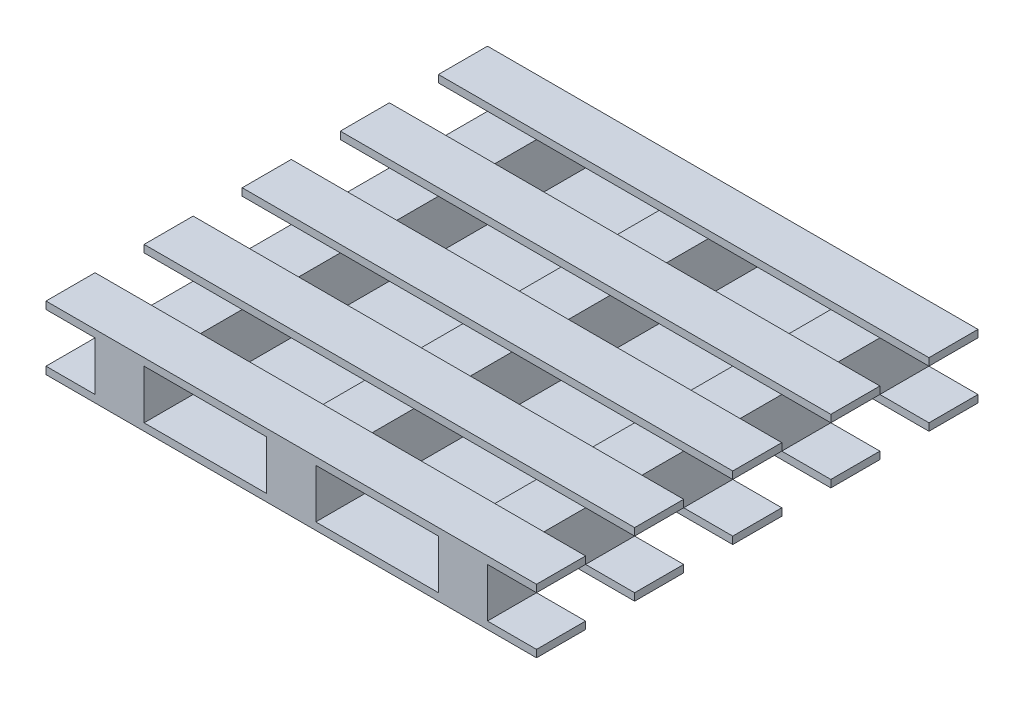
ISO-10303-21;
HEADER;
FILE_DESCRIPTION(('STEP AP214'),'2;1');
FILE_NAME('part.step','',(''),(''),'','','');
FILE_SCHEMA(('AUTOMOTIVE_DESIGN { 1 0 10303 214 1 1 1 1 }'));
ENDSEC;
DATA;
#1=APPLICATION_CONTEXT('core data for automotive mechanical design processes');
#2=APPLICATION_PROTOCOL_DEFINITION('international standard','automotive_design',2000,#1);
#3=PRODUCT_CONTEXT('',#1,'mechanical');
#4=PRODUCT('Part','Part','',(#3));
#5=PRODUCT_RELATED_PRODUCT_CATEGORY('part','',(#4));
#6=PRODUCT_DEFINITION_FORMATION('','',#4);
#7=PRODUCT_DEFINITION_CONTEXT('part definition',#1,'design');
#8=PRODUCT_DEFINITION('design','',#6,#7);
#9=PRODUCT_DEFINITION_SHAPE('','',#8);
#10=(LENGTH_UNIT() NAMED_UNIT(*) SI_UNIT(.MILLI.,.METRE.));
#11=(NAMED_UNIT(*) PLANE_ANGLE_UNIT() SI_UNIT($,.RADIAN.));
#12=(NAMED_UNIT(*) SI_UNIT($,.STERADIAN.) SOLID_ANGLE_UNIT());
#13=UNCERTAINTY_MEASURE_WITH_UNIT(LENGTH_MEASURE(1.E-05),#10,'distance_accuracy_value','');
#14=(GEOMETRIC_REPRESENTATION_CONTEXT(3) GLOBAL_UNCERTAINTY_ASSIGNED_CONTEXT((#13)) GLOBAL_UNIT_ASSIGNED_CONTEXT((#10,
#11,#12)) REPRESENTATION_CONTEXT('',''));
#15=CARTESIAN_POINT('',(0.,0.,0.));
#16=DIRECTION('',(0.,0.,1.));
#17=DIRECTION('',(1.,0.,0.));
#18=AXIS2_PLACEMENT_3D('',#15,#16,#17);
#19=CARTESIAN_POINT('',(-500.,15.,-450.));
#20=DIRECTION('',(0.,-1.,0.));
#21=DIRECTION('',(0.,0.,-1.));
#22=AXIS2_PLACEMENT_3D('',#19,#20,#21);
#23=PLANE('',#22);
#24=DIRECTION('',(0.,0.,1.));
#25=VECTOR('',#24,1.);
#26=CARTESIAN_POINT('',(300.,15.,-450.));
#27=LINE('',#26,#25);
#28=CARTESIAN_POINT('',(300.,15.,-250.));
#29=VERTEX_POINT('',#28);
#30=CARTESIAN_POINT('',(300.,15.,-150.));
#31=VERTEX_POINT('',#30);
#32=EDGE_CURVE('E1220',#29,#31,#27,.T.);
#33=ORIENTED_EDGE('',*,*,#32,.F.);
#34=DIRECTION('',(-1.,0.,0.));
#35=VECTOR('',#34,1.);
#36=CARTESIAN_POINT('',(-500.,15.,-250.));
#37=LINE('',#36,#35);
#38=CARTESIAN_POINT('',(50.,15.,-250.));
#39=VERTEX_POINT('',#38);
#40=EDGE_CURVE('E1462',#29,#39,#37,.T.);
#41=ORIENTED_EDGE('',*,*,#40,.T.);
#42=DIRECTION('',(0.,0.,-1.));
#43=VECTOR('',#42,1.);
#44=CARTESIAN_POINT('',(50.,15.,-450.));
#45=LINE('',#44,#43);
#46=CARTESIAN_POINT('',(50.,15.,-150.));
#47=VERTEX_POINT('',#46);
#48=EDGE_CURVE('E1340',#47,#39,#45,.T.);
#49=ORIENTED_EDGE('',*,*,#48,.F.);
#50=DIRECTION('',(1.,0.,0.));
#51=VECTOR('',#50,1.);
#52=CARTESIAN_POINT('',(500.,15.,-150.));
#53=LINE('',#52,#51);
#54=EDGE_CURVE('E895',#47,#31,#53,.T.);
#55=ORIENTED_EDGE('',*,*,#54,.T.);
#56=EDGE_LOOP('',(#33,#41,#49,#55));
#57=FACE_BOUND('',#56,.T.);
#58=ADVANCED_FACE('F31',(#57),#23,.F.);
#59=DIRECTION('',(0.,0.,-1.));
#60=VECTOR('',#59,1.);
#61=CARTESIAN_POINT('',(500.,15.,450.));
#62=LINE('',#61,#60);
#63=CARTESIAN_POINT('',(500.,15.,-150.));
#64=VERTEX_POINT('',#63);
#65=CARTESIAN_POINT('',(500.,15.,-250.));
#66=VERTEX_POINT('',#65);
#67=EDGE_CURVE('E1484',#64,#66,#62,.T.);
#68=ORIENTED_EDGE('',*,*,#67,.T.);
#69=CARTESIAN_POINT('',(400.,15.,-250.));
#70=VERTEX_POINT('',#69);
#71=EDGE_CURVE('E672',#66,#70,#37,.T.);
#72=ORIENTED_EDGE('',*,*,#71,.T.);
#73=DIRECTION('',(0.,0.,-1.));
#74=VECTOR('',#73,1.);
#75=CARTESIAN_POINT('',(400.,15.,-450.));
#76=LINE('',#75,#74);
#77=CARTESIAN_POINT('',(400.,15.,-150.));
#78=VERTEX_POINT('',#77);
#79=EDGE_CURVE('E1228',#78,#70,#76,.T.);
#80=ORIENTED_EDGE('',*,*,#79,.F.);
#81=EDGE_CURVE('E882',#78,#64,#53,.T.);
#82=ORIENTED_EDGE('',*,*,#81,.T.);
#83=EDGE_LOOP('',(#68,#72,#80,#82));
#84=FACE_BOUND('',#83,.T.);
#85=ADVANCED_FACE('F1412',(#84),#23,.F.);
#86=DIRECTION('',(0.,0.,1.));
#87=VECTOR('',#86,1.);
#88=CARTESIAN_POINT('',(-50.,15.,-450.));
#89=LINE('',#88,#87);
#90=CARTESIAN_POINT('',(-50.,15.,-250.));
#91=VERTEX_POINT('',#90);
#92=CARTESIAN_POINT('',(-50.,15.,-150.));
#93=VERTEX_POINT('',#92);
#94=EDGE_CURVE('E791',#91,#93,#89,.T.);
#95=ORIENTED_EDGE('',*,*,#94,.F.);
#96=CARTESIAN_POINT('',(-300.,15.,-250.));
#97=VERTEX_POINT('',#96);
#98=EDGE_CURVE('E1464',#91,#97,#37,.T.);
#99=ORIENTED_EDGE('',*,*,#98,.T.);
#100=DIRECTION('',(0.,0.,-1.));
#101=VECTOR('',#100,1.);
#102=CARTESIAN_POINT('',(-300.,15.,-450.));
#103=LINE('',#102,#101);
#104=CARTESIAN_POINT('',(-300.,15.,-150.));
#105=VERTEX_POINT('',#104);
#106=EDGE_CURVE('E835',#105,#97,#103,.T.);
#107=ORIENTED_EDGE('',*,*,#106,.F.);
#108=EDGE_CURVE('E877',#105,#93,#53,.T.);
#109=ORIENTED_EDGE('',*,*,#108,.T.);
#110=EDGE_LOOP('',(#95,#99,#107,#109));
#111=FACE_BOUND('',#110,.T.);
#112=ADVANCED_FACE('F1418',(#111),#23,.F.);
#113=DIRECTION('',(0.,0.,1.));
#114=VECTOR('',#113,1.);
#115=CARTESIAN_POINT('',(-400.,15.,-450.));
#116=LINE('',#115,#114);
#117=CARTESIAN_POINT('',(-400.,15.,-250.));
#118=VERTEX_POINT('',#117);
#119=CARTESIAN_POINT('',(-400.,15.,-150.));
#120=VERTEX_POINT('',#119);
#121=EDGE_CURVE('E35',#118,#120,#116,.T.);
#122=ORIENTED_EDGE('',*,*,#121,.F.);
#123=CARTESIAN_POINT('',(-500.,15.,-250.));
#124=VERTEX_POINT('',#123);
#125=EDGE_CURVE('E661',#118,#124,#37,.T.);
#126=ORIENTED_EDGE('',*,*,#125,.T.);
#127=DIRECTION('',(0.,0.,1.));
#128=VECTOR('',#127,1.);
#129=CARTESIAN_POINT('',(-500.,15.,450.));
#130=LINE('',#129,#128);
#131=CARTESIAN_POINT('',(-500.,15.,-150.));
#132=VERTEX_POINT('',#131);
#133=EDGE_CURVE('E679',#124,#132,#130,.T.);
#134=ORIENTED_EDGE('',*,*,#133,.T.);
#135=EDGE_CURVE('E873',#132,#120,#53,.T.);
#136=ORIENTED_EDGE('',*,*,#135,.T.);
#137=EDGE_LOOP('',(#122,#126,#134,#136));
#138=FACE_BOUND('',#137,.T.);
#139=ADVANCED_FACE('F879',(#138),#23,.F.);
#140=CARTESIAN_POINT('',(-500.,15.,450.));
#141=DIRECTION('',(1.,0.,0.));
#142=DIRECTION('',(0.,0.,-1.));
#143=AXIS2_PLACEMENT_3D('',#140,#141,#142);
#144=PLANE('',#143);
#145=ORIENTED_EDGE('',*,*,#133,.F.);
#146=DIRECTION('',(0.,-1.,0.));
#147=VECTOR('',#146,1.);
#148=CARTESIAN_POINT('',(-500.,15.,-250.));
#149=LINE('',#148,#147);
#150=CARTESIAN_POINT('',(-500.,0.,-250.));
#151=VERTEX_POINT('',#150);
#152=EDGE_CURVE('E1450',#124,#151,#149,.T.);
#153=ORIENTED_EDGE('',*,*,#152,.T.);
#154=DIRECTION('',(0.,0.,1.));
#155=VECTOR('',#154,1.);
#156=CARTESIAN_POINT('',(-500.,0.,450.));
#157=LINE('',#156,#155);
#158=CARTESIAN_POINT('',(-500.,0.,-150.));
#159=VERTEX_POINT('',#158);
#160=EDGE_CURVE('E1276',#151,#159,#157,.T.);
#161=ORIENTED_EDGE('',*,*,#160,.T.);
#162=DIRECTION('',(0.,-1.,0.));
#163=VECTOR('',#162,1.);
#164=CARTESIAN_POINT('',(-500.,15.,-150.));
#165=LINE('',#164,#163);
#166=EDGE_CURVE('E911',#132,#159,#165,.T.);
#167=ORIENTED_EDGE('',*,*,#166,.F.);
#168=EDGE_LOOP('',(#145,#153,#161,#167));
#169=FACE_BOUND('',#168,.T.);
#170=ADVANCED_FACE('F1429',(#169),#144,.F.);
#171=CARTESIAN_POINT('',(500.,15.,450.));
#172=DIRECTION('',(-1.,0.,0.));
#173=DIRECTION('',(0.,0.,1.));
#174=AXIS2_PLACEMENT_3D('',#171,#172,#173);
#175=PLANE('',#174);
#176=DIRECTION('',(0.,0.,-1.));
#177=VECTOR('',#176,1.);
#178=CARTESIAN_POINT('',(500.,0.,450.));
#179=LINE('',#178,#177);
#180=CARTESIAN_POINT('',(500.,0.,-150.));
#181=VERTEX_POINT('',#180);
#182=CARTESIAN_POINT('',(500.,0.,-250.));
#183=VERTEX_POINT('',#182);
#184=EDGE_CURVE('E1261',#181,#183,#179,.T.);
#185=ORIENTED_EDGE('',*,*,#184,.T.);
#186=DIRECTION('',(0.,-1.,0.));
#187=VECTOR('',#186,1.);
#188=CARTESIAN_POINT('',(500.,15.,-250.));
#189=LINE('',#188,#187);
#190=EDGE_CURVE('E1453',#66,#183,#189,.T.);
#191=ORIENTED_EDGE('',*,*,#190,.F.);
#192=ORIENTED_EDGE('',*,*,#67,.F.);
#193=DIRECTION('',(0.,-1.,0.));
#194=VECTOR('',#193,1.);
#195=CARTESIAN_POINT('',(500.,15.,-150.));
#196=LINE('',#195,#194);
#197=EDGE_CURVE('E908',#64,#181,#196,.T.);
#198=ORIENTED_EDGE('',*,*,#197,.T.);
#199=EDGE_LOOP('',(#185,#191,#192,#198));
#200=FACE_BOUND('',#199,.T.);
#201=ADVANCED_FACE('F1848',(#200),#175,.F.);
#202=CARTESIAN_POINT('',(-500.,0.,-450.));
#203=DIRECTION('',(0.,-1.,0.));
#204=DIRECTION('',(0.,0.,-1.));
#205=AXIS2_PLACEMENT_3D('',#202,#203,#204);
#206=PLANE('',#205);
#207=DIRECTION('',(-1.,0.,0.));
#208=VECTOR('',#207,1.);
#209=CARTESIAN_POINT('',(-500.,0.,-250.));
#210=LINE('',#209,#208);
#211=EDGE_CURVE('E1457',#183,#151,#210,.T.);
#212=ORIENTED_EDGE('',*,*,#211,.F.);
#213=ORIENTED_EDGE('',*,*,#184,.F.);
#214=DIRECTION('',(1.,0.,0.));
#215=VECTOR('',#214,1.);
#216=CARTESIAN_POINT('',(500.,0.,-150.));
#217=LINE('',#216,#215);
#218=EDGE_CURVE('E896',#159,#181,#217,.T.);
#219=ORIENTED_EDGE('',*,*,#218,.F.);
#220=ORIENTED_EDGE('',*,*,#160,.F.);
#221=EDGE_LOOP('',(#212,#213,#219,#220));
#222=FACE_BOUND('',#221,.T.);
#223=ADVANCED_FACE('F1862',(#222),#206,.T.);
#224=CARTESIAN_POINT('',(300.,15.,-49.9999999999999));
#225=VERTEX_POINT('',#224);
#226=CARTESIAN_POINT('',(300.,15.,50.0000000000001));
#227=VERTEX_POINT('',#226);
#228=EDGE_CURVE('E1335',#225,#227,#27,.T.);
#229=ORIENTED_EDGE('',*,*,#228,.F.);
#230=DIRECTION('',(-1.,0.,0.));
#231=VECTOR('',#230,1.);
#232=CARTESIAN_POINT('',(-500.,15.,-50.));
#233=LINE('',#232,#231);
#234=CARTESIAN_POINT('',(50.,15.,-50.));
#235=VERTEX_POINT('',#234);
#236=EDGE_CURVE('E1318',#225,#235,#233,.T.);
#237=ORIENTED_EDGE('',*,*,#236,.T.);
#238=CARTESIAN_POINT('',(50.,15.,50.0000000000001));
#239=VERTEX_POINT('',#238);
#240=EDGE_CURVE('E1334',#239,#235,#45,.T.);
#241=ORIENTED_EDGE('',*,*,#240,.F.);
#242=DIRECTION('',(1.,0.,0.));
#243=VECTOR('',#242,1.);
#244=CARTESIAN_POINT('',(500.,15.,50.0000000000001));
#245=LINE('',#244,#243);
#246=EDGE_CURVE('E2773',#239,#227,#245,.T.);
#247=ORIENTED_EDGE('',*,*,#246,.T.);
#248=EDGE_LOOP('',(#229,#237,#241,#247));
#249=FACE_BOUND('',#248,.T.);
#250=ADVANCED_FACE('F1332',(#249),#23,.F.);
#251=CARTESIAN_POINT('',(500.,15.,50.0000000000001));
#252=VERTEX_POINT('',#251);
#253=CARTESIAN_POINT('',(500.,15.,-50.));
#254=VERTEX_POINT('',#253);
#255=EDGE_CURVE('E1485',#252,#254,#62,.T.);
#256=ORIENTED_EDGE('',*,*,#255,.T.);
#257=CARTESIAN_POINT('',(400.,15.,-50.));
#258=VERTEX_POINT('',#257);
#259=EDGE_CURVE('E885',#254,#258,#233,.T.);
#260=ORIENTED_EDGE('',*,*,#259,.T.);
#261=CARTESIAN_POINT('',(400.,15.,50.0000000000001));
#262=VERTEX_POINT('',#261);
#263=EDGE_CURVE('E1232',#262,#258,#76,.T.);
#264=ORIENTED_EDGE('',*,*,#263,.F.);
#265=EDGE_CURVE('E928',#262,#252,#245,.T.);
#266=ORIENTED_EDGE('',*,*,#265,.T.);
#267=EDGE_LOOP('',(#256,#260,#264,#266));
#268=FACE_BOUND('',#267,.T.);
#269=ADVANCED_FACE('F1491',(#268),#23,.F.);
#270=CARTESIAN_POINT('',(-50.,15.,-49.9999999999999));
#271=VERTEX_POINT('',#270);
#272=CARTESIAN_POINT('',(-50.,15.,50.0000000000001));
#273=VERTEX_POINT('',#272);
#274=EDGE_CURVE('E1315',#271,#273,#89,.T.);
#275=ORIENTED_EDGE('',*,*,#274,.F.);
#276=CARTESIAN_POINT('',(-300.,15.,-50.));
#277=VERTEX_POINT('',#276);
#278=EDGE_CURVE('E1314',#271,#277,#233,.T.);
#279=ORIENTED_EDGE('',*,*,#278,.T.);
#280=CARTESIAN_POINT('',(-300.,15.,50.0000000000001));
#281=VERTEX_POINT('',#280);
#282=EDGE_CURVE('E843',#281,#277,#103,.T.);
#283=ORIENTED_EDGE('',*,*,#282,.F.);
#284=EDGE_CURVE('E1312',#281,#273,#245,.T.);
#285=ORIENTED_EDGE('',*,*,#284,.T.);
#286=EDGE_LOOP('',(#275,#279,#283,#285));
#287=FACE_BOUND('',#286,.T.);
#288=ADVANCED_FACE('F1311',(#287),#23,.F.);
#289=CARTESIAN_POINT('',(-400.,15.,-50.));
#290=VERTEX_POINT('',#289);
#291=CARTESIAN_POINT('',(-400.,15.,50.0000000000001));
#292=VERTEX_POINT('',#291);
#293=EDGE_CURVE('E834',#290,#292,#116,.T.);
#294=ORIENTED_EDGE('',*,*,#293,.F.);
#295=CARTESIAN_POINT('',(-500.,15.,-50.));
#296=VERTEX_POINT('',#295);
#297=EDGE_CURVE('E881',#290,#296,#233,.T.);
#298=ORIENTED_EDGE('',*,*,#297,.T.);
#299=CARTESIAN_POINT('',(-500.,15.,50.0000000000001));
#300=VERTEX_POINT('',#299);
#301=EDGE_CURVE('E684',#296,#300,#130,.T.);
#302=ORIENTED_EDGE('',*,*,#301,.T.);
#303=EDGE_CURVE('E923',#300,#292,#245,.T.);
#304=ORIENTED_EDGE('',*,*,#303,.T.);
#305=EDGE_LOOP('',(#294,#298,#302,#304));
#306=FACE_BOUND('',#305,.T.);
#307=ADVANCED_FACE('F1509',(#306),#23,.F.);
#308=ORIENTED_EDGE('',*,*,#301,.F.);
#309=DIRECTION('',(0.,-1.,0.));
#310=VECTOR('',#309,1.);
#311=CARTESIAN_POINT('',(-500.,15.,-50.));
#312=LINE('',#311,#310);
#313=CARTESIAN_POINT('',(-500.,0.,-50.));
#314=VERTEX_POINT('',#313);
#315=EDGE_CURVE('E903',#296,#314,#312,.T.);
#316=ORIENTED_EDGE('',*,*,#315,.T.);
#317=CARTESIAN_POINT('',(-500.,0.,50.0000000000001));
#318=VERTEX_POINT('',#317);
#319=EDGE_CURVE('E1278',#314,#318,#157,.T.);
#320=ORIENTED_EDGE('',*,*,#319,.T.);
#321=DIRECTION('',(0.,-1.,0.));
#322=VECTOR('',#321,1.);
#323=CARTESIAN_POINT('',(-500.,15.,50.0000000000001));
#324=LINE('',#323,#322);
#325=EDGE_CURVE('E932',#300,#318,#324,.T.);
#326=ORIENTED_EDGE('',*,*,#325,.F.);
#327=EDGE_LOOP('',(#308,#316,#320,#326));
#328=FACE_BOUND('',#327,.T.);
#329=ADVANCED_FACE('F1502',(#328),#144,.F.);
#330=CARTESIAN_POINT('',(500.,0.,50.0000000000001));
#331=VERTEX_POINT('',#330);
#332=CARTESIAN_POINT('',(500.,0.,-50.));
#333=VERTEX_POINT('',#332);
#334=EDGE_CURVE('E1259',#331,#333,#179,.T.);
#335=ORIENTED_EDGE('',*,*,#334,.T.);
#336=DIRECTION('',(0.,-1.,0.));
#337=VECTOR('',#336,1.);
#338=CARTESIAN_POINT('',(500.,15.,-50.));
#339=LINE('',#338,#337);
#340=EDGE_CURVE('E906',#254,#333,#339,.T.);
#341=ORIENTED_EDGE('',*,*,#340,.F.);
#342=ORIENTED_EDGE('',*,*,#255,.F.);
#343=DIRECTION('',(0.,-1.,0.));
#344=VECTOR('',#343,1.);
#345=CARTESIAN_POINT('',(500.,15.,50.0000000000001));
#346=LINE('',#345,#344);
#347=EDGE_CURVE('E943',#252,#331,#346,.T.);
#348=ORIENTED_EDGE('',*,*,#347,.T.);
#349=EDGE_LOOP('',(#335,#341,#342,#348));
#350=FACE_BOUND('',#349,.T.);
#351=ADVANCED_FACE('F1493',(#350),#175,.F.);
#352=DIRECTION('',(-1.,0.,0.));
#353=VECTOR('',#352,1.);
#354=CARTESIAN_POINT('',(-500.,0.,-50.));
#355=LINE('',#354,#353);
#356=EDGE_CURVE('E889',#333,#314,#355,.T.);
#357=ORIENTED_EDGE('',*,*,#356,.F.);
#358=ORIENTED_EDGE('',*,*,#334,.F.);
#359=DIRECTION('',(1.,0.,0.));
#360=VECTOR('',#359,1.);
#361=CARTESIAN_POINT('',(500.,0.,50.0000000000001));
#362=LINE('',#361,#360);
#363=EDGE_CURVE('E866',#318,#331,#362,.T.);
#364=ORIENTED_EDGE('',*,*,#363,.F.);
#365=ORIENTED_EDGE('',*,*,#319,.F.);
#366=EDGE_LOOP('',(#357,#358,#364,#365));
#367=FACE_BOUND('',#366,.T.);
#368=ADVANCED_FACE('F1497',(#367),#206,.T.);
#369=CARTESIAN_POINT('',(300.,15.,150.));
#370=VERTEX_POINT('',#369);
#371=CARTESIAN_POINT('',(300.,15.,250.));
#372=VERTEX_POINT('',#371);
#373=EDGE_CURVE('E2760',#370,#372,#27,.T.);
#374=ORIENTED_EDGE('',*,*,#373,.F.);
#375=DIRECTION('',(-1.,0.,0.));
#376=VECTOR('',#375,1.);
#377=CARTESIAN_POINT('',(-500.,15.,150.));
#378=LINE('',#377,#376);
#379=CARTESIAN_POINT('',(50.,15.,150.));
#380=VERTEX_POINT('',#379);
#381=EDGE_CURVE('E2775',#370,#380,#378,.T.);
#382=ORIENTED_EDGE('',*,*,#381,.T.);
#383=CARTESIAN_POINT('',(50.,15.,250.));
#384=VERTEX_POINT('',#383);
#385=EDGE_CURVE('E795',#384,#380,#45,.T.);
#386=ORIENTED_EDGE('',*,*,#385,.F.);
#387=DIRECTION('',(1.,0.,0.));
#388=VECTOR('',#387,1.);
#389=CARTESIAN_POINT('',(500.,15.,250.));
#390=LINE('',#389,#388);
#391=EDGE_CURVE('E2750',#384,#372,#390,.T.);
#392=ORIENTED_EDGE('',*,*,#391,.T.);
#393=EDGE_LOOP('',(#374,#382,#386,#392));
#394=FACE_BOUND('',#393,.T.);
#395=ADVANCED_FACE('F2629',(#394),#23,.F.);
#396=CARTESIAN_POINT('',(500.,15.,250.));
#397=VERTEX_POINT('',#396);
#398=CARTESIAN_POINT('',(500.,15.,150.));
#399=VERTEX_POINT('',#398);
#400=EDGE_CURVE('E1246',#397,#399,#62,.T.);
#401=ORIENTED_EDGE('',*,*,#400,.T.);
#402=CARTESIAN_POINT('',(400.,15.,150.));
#403=VERTEX_POINT('',#402);
#404=EDGE_CURVE('E929',#399,#403,#378,.T.);
#405=ORIENTED_EDGE('',*,*,#404,.T.);
#406=CARTESIAN_POINT('',(400.,15.,250.));
#407=VERTEX_POINT('',#406);
#408=EDGE_CURVE('E1226',#407,#403,#76,.T.);
#409=ORIENTED_EDGE('',*,*,#408,.F.);
#410=EDGE_CURVE('E1087',#407,#397,#390,.T.);
#411=ORIENTED_EDGE('',*,*,#410,.T.);
#412=EDGE_LOOP('',(#401,#405,#409,#411));
#413=FACE_BOUND('',#412,.T.);
#414=ADVANCED_FACE('F1243',(#413),#23,.F.);
#415=CARTESIAN_POINT('',(-50.,15.,150.));
#416=VERTEX_POINT('',#415);
#417=CARTESIAN_POINT('',(-50.,15.,250.));
#418=VERTEX_POINT('',#417);
#419=EDGE_CURVE('E1567',#416,#418,#89,.T.);
#420=ORIENTED_EDGE('',*,*,#419,.F.);
#421=CARTESIAN_POINT('',(-300.,15.,150.));
#422=VERTEX_POINT('',#421);
#423=EDGE_CURVE('E1519',#416,#422,#378,.T.);
#424=ORIENTED_EDGE('',*,*,#423,.T.);
#425=CARTESIAN_POINT('',(-300.,15.,250.));
#426=VERTEX_POINT('',#425);
#427=EDGE_CURVE('E1300',#426,#422,#103,.T.);
#428=ORIENTED_EDGE('',*,*,#427,.F.);
#429=EDGE_CURVE('E2746',#426,#418,#390,.T.);
#430=ORIENTED_EDGE('',*,*,#429,.T.);
#431=EDGE_LOOP('',(#420,#424,#428,#430));
#432=FACE_BOUND('',#431,.T.);
#433=ADVANCED_FACE('F2666',(#432),#23,.F.);
#434=CARTESIAN_POINT('',(-400.,15.,150.));
#435=VERTEX_POINT('',#434);
#436=CARTESIAN_POINT('',(-400.,15.,250.));
#437=VERTEX_POINT('',#436);
#438=EDGE_CURVE('E831',#435,#437,#116,.T.);
#439=ORIENTED_EDGE('',*,*,#438,.F.);
#440=CARTESIAN_POINT('',(-500.,15.,150.));
#441=VERTEX_POINT('',#440);
#442=EDGE_CURVE('E926',#435,#441,#378,.T.);
#443=ORIENTED_EDGE('',*,*,#442,.T.);
#444=CARTESIAN_POINT('',(-500.,15.,250.));
#445=VERTEX_POINT('',#444);
#446=EDGE_CURVE('E687',#441,#445,#130,.T.);
#447=ORIENTED_EDGE('',*,*,#446,.T.);
#448=EDGE_CURVE('E1082',#445,#437,#390,.T.);
#449=ORIENTED_EDGE('',*,*,#448,.T.);
#450=EDGE_LOOP('',(#439,#443,#447,#449));
#451=FACE_BOUND('',#450,.T.);
#452=ADVANCED_FACE('F1522',(#451),#23,.F.);
#453=ORIENTED_EDGE('',*,*,#446,.F.);
#454=DIRECTION('',(0.,-1.,0.));
#455=VECTOR('',#454,1.);
#456=CARTESIAN_POINT('',(-500.,15.,150.));
#457=LINE('',#456,#455);
#458=CARTESIAN_POINT('',(-500.,0.,150.));
#459=VERTEX_POINT('',#458);
#460=EDGE_CURVE('E937',#441,#459,#457,.T.);
#461=ORIENTED_EDGE('',*,*,#460,.T.);
#462=CARTESIAN_POINT('',(-500.,0.,250.));
#463=VERTEX_POINT('',#462);
#464=EDGE_CURVE('E1279',#459,#463,#157,.T.);
#465=ORIENTED_EDGE('',*,*,#464,.T.);
#466=DIRECTION('',(0.,-1.,0.));
#467=VECTOR('',#466,1.);
#468=CARTESIAN_POINT('',(-500.,15.,250.));
#469=LINE('',#468,#467);
#470=EDGE_CURVE('E1091',#445,#463,#469,.T.);
#471=ORIENTED_EDGE('',*,*,#470,.F.);
#472=EDGE_LOOP('',(#453,#461,#465,#471));
#473=FACE_BOUND('',#472,.T.);
#474=ADVANCED_FACE('F2510',(#473),#144,.F.);
#475=CARTESIAN_POINT('',(500.,0.,250.));
#476=VERTEX_POINT('',#475);
#477=CARTESIAN_POINT('',(500.,0.,150.));
#478=VERTEX_POINT('',#477);
#479=EDGE_CURVE('E700',#476,#478,#179,.T.);
#480=ORIENTED_EDGE('',*,*,#479,.T.);
#481=DIRECTION('',(0.,-1.,0.));
#482=VECTOR('',#481,1.);
#483=CARTESIAN_POINT('',(500.,15.,150.));
#484=LINE('',#483,#482);
#485=EDGE_CURVE('E941',#399,#478,#484,.T.);
#486=ORIENTED_EDGE('',*,*,#485,.F.);
#487=ORIENTED_EDGE('',*,*,#400,.F.);
#488=DIRECTION('',(0.,-1.,0.));
#489=VECTOR('',#488,1.);
#490=CARTESIAN_POINT('',(500.,15.,250.));
#491=LINE('',#490,#489);
#492=EDGE_CURVE('E1102',#397,#476,#491,.T.);
#493=ORIENTED_EDGE('',*,*,#492,.T.);
#494=EDGE_LOOP('',(#480,#486,#487,#493));
#495=FACE_BOUND('',#494,.T.);
#496=ADVANCED_FACE('F1255',(#495),#175,.F.);
#497=DIRECTION('',(-1.,0.,0.));
#498=VECTOR('',#497,1.);
#499=CARTESIAN_POINT('',(-500.,0.,150.));
#500=LINE('',#499,#498);
#501=EDGE_CURVE('E935',#478,#459,#500,.T.);
#502=ORIENTED_EDGE('',*,*,#501,.F.);
#503=ORIENTED_EDGE('',*,*,#479,.F.);
#504=DIRECTION('',(1.,0.,0.));
#505=VECTOR('',#504,1.);
#506=CARTESIAN_POINT('',(500.,0.,250.));
#507=LINE('',#506,#505);
#508=EDGE_CURVE('E1081',#463,#476,#507,.T.);
#509=ORIENTED_EDGE('',*,*,#508,.F.);
#510=ORIENTED_EDGE('',*,*,#464,.F.);
#511=EDGE_LOOP('',(#502,#503,#509,#510));
#512=FACE_BOUND('',#511,.T.);
#513=ADVANCED_FACE('F1801',(#512),#206,.T.);
#514=CARTESIAN_POINT('',(500.,115.,450.));
#515=DIRECTION('',(0.,1.,0.));
#516=DIRECTION('',(0.,0.,1.));
#517=AXIS2_PLACEMENT_3D('',#514,#515,#516);
#518=PLANE('',#517);
#519=DIRECTION('',(0.,0.,1.));
#520=VECTOR('',#519,1.);
#521=CARTESIAN_POINT('',(-400.,115.,-450.));
#522=LINE('',#521,#520);
#523=CARTESIAN_POINT('',(-400.,115.,-450.));
#524=VERTEX_POINT('',#523);
#525=CARTESIAN_POINT('',(-400.,115.,-350.));
#526=VERTEX_POINT('',#525);
#527=EDGE_CURVE('E808',#524,#526,#522,.T.);
#528=ORIENTED_EDGE('',*,*,#527,.T.);
#529=DIRECTION('',(-1.,0.,0.));
#530=VECTOR('',#529,1.);
#531=CARTESIAN_POINT('',(-500.,115.,-350.));
#532=LINE('',#531,#530);
#533=CARTESIAN_POINT('',(-500.,115.,-350.));
#534=VERTEX_POINT('',#533);
#535=EDGE_CURVE('E966',#526,#534,#532,.T.);
#536=ORIENTED_EDGE('',*,*,#535,.T.);
#537=DIRECTION('',(0.,0.,1.));
#538=VECTOR('',#537,1.);
#539=CARTESIAN_POINT('',(-500.,115.,-450.));
#540=LINE('',#539,#538);
#541=CARTESIAN_POINT('',(-500.,115.,-450.));
#542=VERTEX_POINT('',#541);
#543=EDGE_CURVE('E1169',#542,#534,#540,.T.);
#544=ORIENTED_EDGE('',*,*,#543,.F.);
#545=DIRECTION('',(-1.,0.,0.));
#546=VECTOR('',#545,1.);
#547=CARTESIAN_POINT('',(500.,115.,-450.));
#548=LINE('',#547,#546);
#549=EDGE_CURVE('E1190',#524,#542,#548,.T.);
#550=ORIENTED_EDGE('',*,*,#549,.F.);
#551=EDGE_LOOP('',(#528,#536,#544,#550));
#552=FACE_BOUND('',#551,.T.);
#553=ADVANCED_FACE('F1369',(#552),#518,.F.);
#554=DIRECTION('',(0.,0.,1.));
#555=VECTOR('',#554,1.);
#556=CARTESIAN_POINT('',(-50.,115.,-450.));
#557=LINE('',#556,#555);
#558=CARTESIAN_POINT('',(-50.,115.,-450.));
#559=VERTEX_POINT('',#558);
#560=CARTESIAN_POINT('',(-50.,115.,-350.));
#561=VERTEX_POINT('',#560);
#562=EDGE_CURVE('E776',#559,#561,#557,.T.);
#563=ORIENTED_EDGE('',*,*,#562,.T.);
#564=CARTESIAN_POINT('',(-300.,115.,-350.));
#565=VERTEX_POINT('',#564);
#566=EDGE_CURVE('E1374',#561,#565,#532,.T.);
#567=ORIENTED_EDGE('',*,*,#566,.T.);
#568=DIRECTION('',(0.,0.,-1.));
#569=VECTOR('',#568,1.);
#570=CARTESIAN_POINT('',(-300.,115.,-450.));
#571=LINE('',#570,#569);
#572=CARTESIAN_POINT('',(-300.,115.,-450.));
#573=VERTEX_POINT('',#572);
#574=EDGE_CURVE('E811',#565,#573,#571,.T.);
#575=ORIENTED_EDGE('',*,*,#574,.T.);
#576=EDGE_CURVE('E1356',#559,#573,#548,.T.);
#577=ORIENTED_EDGE('',*,*,#576,.F.);
#578=EDGE_LOOP('',(#563,#567,#575,#577));
#579=FACE_BOUND('',#578,.T.);
#580=ADVANCED_FACE('F1399',(#579),#518,.F.);
#581=DIRECTION('',(0.,0.,1.));
#582=VECTOR('',#581,1.);
#583=CARTESIAN_POINT('',(300.,115.,-450.));
#584=LINE('',#583,#582);
#585=CARTESIAN_POINT('',(300.,115.,-450.));
#586=VERTEX_POINT('',#585);
#587=CARTESIAN_POINT('',(300.,115.,-350.));
#588=VERTEX_POINT('',#587);
#589=EDGE_CURVE('E1209',#586,#588,#584,.T.);
#590=ORIENTED_EDGE('',*,*,#589,.T.);
#591=CARTESIAN_POINT('',(50.,115.,-350.));
#592=VERTEX_POINT('',#591);
#593=EDGE_CURVE('E1381',#588,#592,#532,.T.);
#594=ORIENTED_EDGE('',*,*,#593,.T.);
#595=DIRECTION('',(0.,0.,-1.));
#596=VECTOR('',#595,1.);
#597=CARTESIAN_POINT('',(50.,115.,-450.));
#598=LINE('',#597,#596);
#599=CARTESIAN_POINT('',(50.,115.,-450.));
#600=VERTEX_POINT('',#599);
#601=EDGE_CURVE('E779',#592,#600,#598,.T.);
#602=ORIENTED_EDGE('',*,*,#601,.T.);
#603=EDGE_CURVE('E1194',#586,#600,#548,.T.);
#604=ORIENTED_EDGE('',*,*,#603,.F.);
#605=EDGE_LOOP('',(#590,#594,#602,#604));
#606=FACE_BOUND('',#605,.T.);
#607=ADVANCED_FACE('F1396',(#606),#518,.F.);
#608=DIRECTION('',(0.,0.,-1.));
#609=VECTOR('',#608,1.);
#610=CARTESIAN_POINT('',(500.,115.,450.));
#611=LINE('',#610,#609);
#612=CARTESIAN_POINT('',(500.,115.,-350.));
#613=VERTEX_POINT('',#612);
#614=CARTESIAN_POINT('',(500.,115.,-450.));
#615=VERTEX_POINT('',#614);
#616=EDGE_CURVE('E1185',#613,#615,#611,.T.);
#617=ORIENTED_EDGE('',*,*,#616,.F.);
#618=CARTESIAN_POINT('',(400.,115.,-350.));
#619=VERTEX_POINT('',#618);
#620=EDGE_CURVE('E969',#613,#619,#532,.T.);
#621=ORIENTED_EDGE('',*,*,#620,.T.);
#622=DIRECTION('',(0.,0.,-1.));
#623=VECTOR('',#622,1.);
#624=CARTESIAN_POINT('',(400.,115.,-450.));
#625=LINE('',#624,#623);
#626=CARTESIAN_POINT('',(400.,115.,-450.));
#627=VERTEX_POINT('',#626);
#628=EDGE_CURVE('E1212',#619,#627,#625,.T.);
#629=ORIENTED_EDGE('',*,*,#628,.T.);
#630=EDGE_CURVE('E759',#615,#627,#548,.T.);
#631=ORIENTED_EDGE('',*,*,#630,.F.);
#632=EDGE_LOOP('',(#617,#621,#629,#631));
#633=FACE_BOUND('',#632,.T.);
#634=ADVANCED_FACE('F1398',(#633),#518,.F.);
#635=CARTESIAN_POINT('',(500.,130.,450.));
#636=DIRECTION('',(-1.,0.,0.));
#637=DIRECTION('',(0.,0.,1.));
#638=AXIS2_PLACEMENT_3D('',#635,#636,#637);
#639=PLANE('',#638);
#640=DIRECTION('',(0.,0.,-1.));
#641=VECTOR('',#640,1.);
#642=CARTESIAN_POINT('',(500.,130.,450.));
#643=LINE('',#642,#641);
#644=CARTESIAN_POINT('',(500.,130.,-350.));
#645=VERTEX_POINT('',#644);
#646=CARTESIAN_POINT('',(500.,130.,-450.));
#647=VERTEX_POINT('',#646);
#648=EDGE_CURVE('E1168',#645,#647,#643,.T.);
#649=ORIENTED_EDGE('',*,*,#648,.F.);
#650=DIRECTION('',(0.,1.,0.));
#651=VECTOR('',#650,1.);
#652=CARTESIAN_POINT('',(500.,115.,-350.));
#653=LINE('',#652,#651);
#654=EDGE_CURVE('E981',#613,#645,#653,.T.);
#655=ORIENTED_EDGE('',*,*,#654,.F.);
#656=ORIENTED_EDGE('',*,*,#616,.T.);
#657=DIRECTION('',(0.,-1.,0.));
#658=VECTOR('',#657,1.);
#659=CARTESIAN_POINT('',(500.,130.,-450.));
#660=LINE('',#659,#658);
#661=EDGE_CURVE('E1203',#647,#615,#660,.T.);
#662=ORIENTED_EDGE('',*,*,#661,.F.);
#663=EDGE_LOOP('',(#649,#655,#656,#662));
#664=FACE_BOUND('',#663,.T.);
#665=ADVANCED_FACE('F1405',(#664),#639,.F.);
#666=CARTESIAN_POINT('',(-500.,130.,-450.));
#667=DIRECTION('',(1.,0.,0.));
#668=DIRECTION('',(0.,0.,-1.));
#669=AXIS2_PLACEMENT_3D('',#666,#667,#668);
#670=PLANE('',#669);
#671=ORIENTED_EDGE('',*,*,#543,.T.);
#672=DIRECTION('',(0.,1.,0.));
#673=VECTOR('',#672,1.);
#674=CARTESIAN_POINT('',(-500.,115.,-350.));
#675=LINE('',#674,#673);
#676=CARTESIAN_POINT('',(-500.,130.,-350.));
#677=VERTEX_POINT('',#676);
#678=EDGE_CURVE('E977',#534,#677,#675,.T.);
#679=ORIENTED_EDGE('',*,*,#678,.T.);
#680=DIRECTION('',(0.,0.,1.));
#681=VECTOR('',#680,1.);
#682=CARTESIAN_POINT('',(-500.,130.,-450.));
#683=LINE('',#682,#681);
#684=CARTESIAN_POINT('',(-500.,130.,-450.));
#685=VERTEX_POINT('',#684);
#686=EDGE_CURVE('E1177',#685,#677,#683,.T.);
#687=ORIENTED_EDGE('',*,*,#686,.F.);
#688=DIRECTION('',(0.,-1.,0.));
#689=VECTOR('',#688,1.);
#690=CARTESIAN_POINT('',(-500.,130.,-450.));
#691=LINE('',#690,#689);
#692=EDGE_CURVE('E1200',#685,#542,#691,.T.);
#693=ORIENTED_EDGE('',*,*,#692,.T.);
#694=EDGE_LOOP('',(#671,#679,#687,#693));
#695=FACE_BOUND('',#694,.T.);
#696=ADVANCED_FACE('F1367',(#695),#670,.F.);
#697=CARTESIAN_POINT('',(500.,130.,450.));
#698=DIRECTION('',(0.,1.,0.));
#699=DIRECTION('',(0.,0.,1.));
#700=AXIS2_PLACEMENT_3D('',#697,#698,#699);
#701=PLANE('',#700);
#702=DIRECTION('',(-1.,0.,0.));
#703=VECTOR('',#702,1.);
#704=CARTESIAN_POINT('',(-500.,130.,-350.));
#705=LINE('',#704,#703);
#706=EDGE_CURVE('E975',#645,#677,#705,.T.);
#707=ORIENTED_EDGE('',*,*,#706,.F.);
#708=ORIENTED_EDGE('',*,*,#648,.T.);
#709=DIRECTION('',(-1.,0.,0.));
#710=VECTOR('',#709,1.);
#711=CARTESIAN_POINT('',(500.,130.,-450.));
#712=LINE('',#711,#710);
#713=EDGE_CURVE('E1173',#647,#685,#712,.T.);
#714=ORIENTED_EDGE('',*,*,#713,.T.);
#715=ORIENTED_EDGE('',*,*,#686,.T.);
#716=EDGE_LOOP('',(#707,#708,#714,#715));
#717=FACE_BOUND('',#716,.T.);
#718=ADVANCED_FACE('F2178',(#717),#701,.T.);
#719=CARTESIAN_POINT('',(-500.,115.,-250.));
#720=VERTEX_POINT('',#719);
#721=CARTESIAN_POINT('',(-500.,115.,-150.));
#722=VERTEX_POINT('',#721);
#723=EDGE_CURVE('E1197',#720,#722,#540,.T.);
#724=ORIENTED_EDGE('',*,*,#723,.F.);
#725=DIRECTION('',(1.,0.,0.));
#726=VECTOR('',#725,1.);
#727=CARTESIAN_POINT('',(-500.,115.,-250.));
#728=LINE('',#727,#726);
#729=CARTESIAN_POINT('',(-400.,115.,-250.));
#730=VERTEX_POINT('',#729);
#731=EDGE_CURVE('E963',#720,#730,#728,.T.);
#732=ORIENTED_EDGE('',*,*,#731,.T.);
#733=CARTESIAN_POINT('',(-400.,115.,-150.));
#734=VERTEX_POINT('',#733);
#735=EDGE_CURVE('E812',#730,#734,#522,.T.);
#736=ORIENTED_EDGE('',*,*,#735,.T.);
#737=DIRECTION('',(-1.,0.,0.));
#738=VECTOR('',#737,1.);
#739=CARTESIAN_POINT('',(-500.,115.,-150.));
#740=LINE('',#739,#738);
#741=EDGE_CURVE('E1005',#734,#722,#740,.T.);
#742=ORIENTED_EDGE('',*,*,#741,.T.);
#743=EDGE_LOOP('',(#724,#732,#736,#742));
#744=FACE_BOUND('',#743,.T.);
#745=ADVANCED_FACE('F1407',(#744),#518,.F.);
#746=CARTESIAN_POINT('',(-300.,115.,-150.));
#747=VERTEX_POINT('',#746);
#748=CARTESIAN_POINT('',(-300.,115.,-250.));
#749=VERTEX_POINT('',#748);
#750=EDGE_CURVE('E1765',#747,#749,#571,.T.);
#751=ORIENTED_EDGE('',*,*,#750,.T.);
#752=CARTESIAN_POINT('',(-50.,115.,-250.));
#753=VERTEX_POINT('',#752);
#754=EDGE_CURVE('E1779',#749,#753,#728,.T.);
#755=ORIENTED_EDGE('',*,*,#754,.T.);
#756=CARTESIAN_POINT('',(-50.,115.,-150.));
#757=VERTEX_POINT('',#756);
#758=EDGE_CURVE('E780',#753,#757,#557,.T.);
#759=ORIENTED_EDGE('',*,*,#758,.T.);
#760=EDGE_CURVE('E1659',#757,#747,#740,.T.);
#761=ORIENTED_EDGE('',*,*,#760,.T.);
#762=EDGE_LOOP('',(#751,#755,#759,#761));
#763=FACE_BOUND('',#762,.T.);
#764=ADVANCED_FACE('F1783',(#763),#518,.F.);
#765=CARTESIAN_POINT('',(50.,115.,-150.));
#766=VERTEX_POINT('',#765);
#767=CARTESIAN_POINT('',(50.,115.,-250.));
#768=VERTEX_POINT('',#767);
#769=EDGE_CURVE('E2788',#766,#768,#598,.T.);
#770=ORIENTED_EDGE('',*,*,#769,.T.);
#771=CARTESIAN_POINT('',(300.,115.,-250.));
#772=VERTEX_POINT('',#771);
#773=EDGE_CURVE('E1782',#768,#772,#728,.T.);
#774=ORIENTED_EDGE('',*,*,#773,.T.);
#775=CARTESIAN_POINT('',(300.,115.,-150.));
#776=VERTEX_POINT('',#775);
#777=EDGE_CURVE('E1213',#772,#776,#584,.T.);
#778=ORIENTED_EDGE('',*,*,#777,.T.);
#779=EDGE_CURVE('E1668',#776,#766,#740,.T.);
#780=ORIENTED_EDGE('',*,*,#779,.T.);
#781=EDGE_LOOP('',(#770,#774,#778,#780));
#782=FACE_BOUND('',#781,.T.);
#783=ADVANCED_FACE('F2247',(#782),#518,.F.);
#784=CARTESIAN_POINT('',(400.,115.,-150.));
#785=VERTEX_POINT('',#784);
#786=CARTESIAN_POINT('',(400.,115.,-250.));
#787=VERTEX_POINT('',#786);
#788=EDGE_CURVE('E1728',#785,#787,#625,.T.);
#789=ORIENTED_EDGE('',*,*,#788,.T.);
#790=CARTESIAN_POINT('',(500.,115.,-250.));
#791=VERTEX_POINT('',#790);
#792=EDGE_CURVE('E968',#787,#791,#728,.T.);
#793=ORIENTED_EDGE('',*,*,#792,.T.);
#794=CARTESIAN_POINT('',(500.,115.,-150.));
#795=VERTEX_POINT('',#794);
#796=EDGE_CURVE('E1715',#795,#791,#611,.T.);
#797=ORIENTED_EDGE('',*,*,#796,.F.);
#798=EDGE_CURVE('E1008',#795,#785,#740,.T.);
#799=ORIENTED_EDGE('',*,*,#798,.T.);
#800=EDGE_LOOP('',(#789,#793,#797,#799));
#801=FACE_BOUND('',#800,.T.);
#802=ADVANCED_FACE('F2214',(#801),#518,.F.);
#803=ORIENTED_EDGE('',*,*,#796,.T.);
#804=DIRECTION('',(0.,1.,0.));
#805=VECTOR('',#804,1.);
#806=CARTESIAN_POINT('',(500.,115.,-250.));
#807=LINE('',#806,#805);
#808=CARTESIAN_POINT('',(500.,130.,-250.));
#809=VERTEX_POINT('',#808);
#810=EDGE_CURVE('E983',#791,#809,#807,.T.);
#811=ORIENTED_EDGE('',*,*,#810,.T.);
#812=CARTESIAN_POINT('',(500.,130.,-150.));
#813=VERTEX_POINT('',#812);
#814=EDGE_CURVE('E2219',#813,#809,#643,.T.);
#815=ORIENTED_EDGE('',*,*,#814,.F.);
#816=DIRECTION('',(0.,1.,0.));
#817=VECTOR('',#816,1.);
#818=CARTESIAN_POINT('',(500.,115.,-150.));
#819=LINE('',#818,#817);
#820=EDGE_CURVE('E1021',#795,#813,#819,.T.);
#821=ORIENTED_EDGE('',*,*,#820,.F.);
#822=EDGE_LOOP('',(#803,#811,#815,#821));
#823=FACE_BOUND('',#822,.T.);
#824=ADVANCED_FACE('F2215',(#823),#639,.F.);
#825=CARTESIAN_POINT('',(-500.,130.,-250.));
#826=VERTEX_POINT('',#825);
#827=CARTESIAN_POINT('',(-500.,130.,-150.));
#828=VERTEX_POINT('',#827);
#829=EDGE_CURVE('E1181',#826,#828,#683,.T.);
#830=ORIENTED_EDGE('',*,*,#829,.F.);
#831=DIRECTION('',(0.,1.,0.));
#832=VECTOR('',#831,1.);
#833=CARTESIAN_POINT('',(-500.,115.,-250.));
#834=LINE('',#833,#832);
#835=EDGE_CURVE('E972',#720,#826,#834,.T.);
#836=ORIENTED_EDGE('',*,*,#835,.F.);
#837=ORIENTED_EDGE('',*,*,#723,.T.);
#838=DIRECTION('',(0.,1.,0.));
#839=VECTOR('',#838,1.);
#840=CARTESIAN_POINT('',(-500.,115.,-150.));
#841=LINE('',#840,#839);
#842=EDGE_CURVE('E1017',#722,#828,#841,.T.);
#843=ORIENTED_EDGE('',*,*,#842,.T.);
#844=EDGE_LOOP('',(#830,#836,#837,#843));
#845=FACE_BOUND('',#844,.T.);
#846=ADVANCED_FACE('F1648',(#845),#670,.F.);
#847=DIRECTION('',(1.,0.,0.));
#848=VECTOR('',#847,1.);
#849=CARTESIAN_POINT('',(-500.,130.,-250.));
#850=LINE('',#849,#848);
#851=EDGE_CURVE('E962',#826,#809,#850,.T.);
#852=ORIENTED_EDGE('',*,*,#851,.F.);
#853=ORIENTED_EDGE('',*,*,#829,.T.);
#854=DIRECTION('',(-1.,0.,0.));
#855=VECTOR('',#854,1.);
#856=CARTESIAN_POINT('',(-500.,130.,-150.));
#857=LINE('',#856,#855);
#858=EDGE_CURVE('E1014',#813,#828,#857,.T.);
#859=ORIENTED_EDGE('',*,*,#858,.F.);
#860=ORIENTED_EDGE('',*,*,#814,.T.);
#861=EDGE_LOOP('',(#852,#853,#859,#860));
#862=FACE_BOUND('',#861,.T.);
#863=ADVANCED_FACE('F2186',(#862),#701,.T.);
#864=CARTESIAN_POINT('',(-500.,115.,-49.9999999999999));
#865=VERTEX_POINT('',#864);
#866=CARTESIAN_POINT('',(-500.,115.,50.0000000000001));
#867=VERTEX_POINT('',#866);
#868=EDGE_CURVE('E1635',#865,#867,#540,.T.);
#869=ORIENTED_EDGE('',*,*,#868,.F.);
#870=DIRECTION('',(1.,0.,0.));
#871=VECTOR('',#870,1.);
#872=CARTESIAN_POINT('',(-500.,115.,-49.9999999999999));
#873=LINE('',#872,#871);
#874=CARTESIAN_POINT('',(-400.,115.,-50.));
#875=VERTEX_POINT('',#874);
#876=EDGE_CURVE('E1002',#865,#875,#873,.T.);
#877=ORIENTED_EDGE('',*,*,#876,.T.);
#878=CARTESIAN_POINT('',(-400.,115.,50.0000000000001));
#879=VERTEX_POINT('',#878);
#880=EDGE_CURVE('E1786',#875,#879,#522,.T.);
#881=ORIENTED_EDGE('',*,*,#880,.T.);
#882=DIRECTION('',(-1.,0.,0.));
#883=VECTOR('',#882,1.);
#884=CARTESIAN_POINT('',(-500.,115.,50.0000000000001));
#885=LINE('',#884,#883);
#886=EDGE_CURVE('E1045',#879,#867,#885,.T.);
#887=ORIENTED_EDGE('',*,*,#886,.T.);
#888=EDGE_LOOP('',(#869,#877,#881,#887));
#889=FACE_BOUND('',#888,.T.);
#890=ADVANCED_FACE('F2208',(#889),#518,.F.);
#891=CARTESIAN_POINT('',(-300.,115.,50.0000000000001));
#892=VERTEX_POINT('',#891);
#893=CARTESIAN_POINT('',(-300.,115.,-50.));
#894=VERTEX_POINT('',#893);
#895=EDGE_CURVE('E1764',#892,#894,#571,.T.);
#896=ORIENTED_EDGE('',*,*,#895,.T.);
#897=CARTESIAN_POINT('',(-50.,115.,-50.));
#898=VERTEX_POINT('',#897);
#899=EDGE_CURVE('E1754',#894,#898,#873,.T.);
#900=ORIENTED_EDGE('',*,*,#899,.T.);
#901=CARTESIAN_POINT('',(-50.,115.,50.0000000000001));
#902=VERTEX_POINT('',#901);
#903=EDGE_CURVE('E2227',#898,#902,#557,.T.);
#904=ORIENTED_EDGE('',*,*,#903,.T.);
#905=EDGE_CURVE('E1769',#902,#892,#885,.T.);
#906=ORIENTED_EDGE('',*,*,#905,.T.);
#907=EDGE_LOOP('',(#896,#900,#904,#906));
#908=FACE_BOUND('',#907,.T.);
#909=ADVANCED_FACE('F1767',(#908),#518,.F.);
#910=CARTESIAN_POINT('',(50.,115.,50.0000000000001));
#911=VERTEX_POINT('',#910);
#912=CARTESIAN_POINT('',(50.,115.,-50.));
#913=VERTEX_POINT('',#912);
#914=EDGE_CURVE('E2787',#911,#913,#598,.T.);
#915=ORIENTED_EDGE('',*,*,#914,.T.);
#916=CARTESIAN_POINT('',(300.,115.,-50.));
#917=VERTEX_POINT('',#916);
#918=EDGE_CURVE('E1750',#913,#917,#873,.T.);
#919=ORIENTED_EDGE('',*,*,#918,.T.);
#920=CARTESIAN_POINT('',(300.,115.,50.0000000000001));
#921=VERTEX_POINT('',#920);
#922=EDGE_CURVE('E1684',#917,#921,#584,.T.);
#923=ORIENTED_EDGE('',*,*,#922,.T.);
#924=EDGE_CURVE('E1745',#921,#911,#885,.T.);
#925=ORIENTED_EDGE('',*,*,#924,.T.);
#926=EDGE_LOOP('',(#915,#919,#923,#925));
#927=FACE_BOUND('',#926,.T.);
#928=ADVANCED_FACE('F2241',(#927),#518,.F.);
#929=CARTESIAN_POINT('',(400.,115.,50.0000000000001));
#930=VERTEX_POINT('',#929);
#931=CARTESIAN_POINT('',(400.,115.,-49.9999999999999));
#932=VERTEX_POINT('',#931);
#933=EDGE_CURVE('E1733',#930,#932,#625,.T.);
#934=ORIENTED_EDGE('',*,*,#933,.T.);
#935=CARTESIAN_POINT('',(500.,115.,-50.));
#936=VERTEX_POINT('',#935);
#937=EDGE_CURVE('E1007',#932,#936,#873,.T.);
#938=ORIENTED_EDGE('',*,*,#937,.T.);
#939=CARTESIAN_POINT('',(500.,115.,50.0000000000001));
#940=VERTEX_POINT('',#939);
#941=EDGE_CURVE('E1713',#940,#936,#611,.T.);
#942=ORIENTED_EDGE('',*,*,#941,.F.);
#943=EDGE_CURVE('E1048',#940,#930,#885,.T.);
#944=ORIENTED_EDGE('',*,*,#943,.T.);
#945=EDGE_LOOP('',(#934,#938,#942,#944));
#946=FACE_BOUND('',#945,.T.);
#947=ADVANCED_FACE('F1746',(#946),#518,.F.);
#948=ORIENTED_EDGE('',*,*,#941,.T.);
#949=DIRECTION('',(0.,1.,0.));
#950=VECTOR('',#949,1.);
#951=CARTESIAN_POINT('',(500.,115.,-50.));
#952=LINE('',#951,#950);
#953=CARTESIAN_POINT('',(500.,130.,-50.));
#954=VERTEX_POINT('',#953);
#955=EDGE_CURVE('E1023',#936,#954,#952,.T.);
#956=ORIENTED_EDGE('',*,*,#955,.T.);
#957=CARTESIAN_POINT('',(500.,130.,50.0000000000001));
#958=VERTEX_POINT('',#957);
#959=EDGE_CURVE('E2235',#958,#954,#643,.T.);
#960=ORIENTED_EDGE('',*,*,#959,.F.);
#961=DIRECTION('',(0.,1.,0.));
#962=VECTOR('',#961,1.);
#963=CARTESIAN_POINT('',(500.,115.,50.0000000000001));
#964=LINE('',#963,#962);
#965=EDGE_CURVE('E1061',#940,#958,#964,.T.);
#966=ORIENTED_EDGE('',*,*,#965,.F.);
#967=EDGE_LOOP('',(#948,#956,#960,#966));
#968=FACE_BOUND('',#967,.T.);
#969=ADVANCED_FACE('F2205',(#968),#639,.F.);
#970=CARTESIAN_POINT('',(-500.,130.,-49.9999999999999));
#971=VERTEX_POINT('',#970);
#972=CARTESIAN_POINT('',(-500.,130.,50.0000000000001));
#973=VERTEX_POINT('',#972);
#974=EDGE_CURVE('E2220',#971,#973,#683,.T.);
#975=ORIENTED_EDGE('',*,*,#974,.F.);
#976=DIRECTION('',(0.,1.,0.));
#977=VECTOR('',#976,1.);
#978=CARTESIAN_POINT('',(-500.,115.,-49.9999999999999));
#979=LINE('',#978,#977);
#980=EDGE_CURVE('E1011',#865,#971,#979,.T.);
#981=ORIENTED_EDGE('',*,*,#980,.F.);
#982=ORIENTED_EDGE('',*,*,#868,.T.);
#983=DIRECTION('',(0.,1.,0.));
#984=VECTOR('',#983,1.);
#985=CARTESIAN_POINT('',(-500.,115.,50.0000000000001));
#986=LINE('',#985,#984);
#987=EDGE_CURVE('E1057',#867,#973,#986,.T.);
#988=ORIENTED_EDGE('',*,*,#987,.T.);
#989=EDGE_LOOP('',(#975,#981,#982,#988));
#990=FACE_BOUND('',#989,.T.);
#991=ADVANCED_FACE('F2194',(#990),#670,.F.);
#992=DIRECTION('',(1.,0.,0.));
#993=VECTOR('',#992,1.);
#994=CARTESIAN_POINT('',(-500.,130.,-49.9999999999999));
#995=LINE('',#994,#993);
#996=EDGE_CURVE('E1001',#971,#954,#995,.T.);
#997=ORIENTED_EDGE('',*,*,#996,.F.);
#998=ORIENTED_EDGE('',*,*,#974,.T.);
#999=DIRECTION('',(-1.,0.,0.));
#1000=VECTOR('',#999,1.);
#1001=CARTESIAN_POINT('',(-500.,130.,50.0000000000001));
#1002=LINE('',#1001,#1000);
#1003=EDGE_CURVE('E1054',#958,#973,#1002,.T.);
#1004=ORIENTED_EDGE('',*,*,#1003,.F.);
#1005=ORIENTED_EDGE('',*,*,#959,.T.);
#1006=EDGE_LOOP('',(#997,#998,#1004,#1005));
#1007=FACE_BOUND('',#1006,.T.);
#1008=ADVANCED_FACE('F2189',(#1007),#701,.T.);
#1009=CARTESIAN_POINT('',(300.,15.,350.));
#1010=VERTEX_POINT('',#1009);
#1011=CARTESIAN_POINT('',(300.,15.,450.));
#1012=VERTEX_POINT('',#1011);
#1013=EDGE_CURVE('E1208',#1010,#1012,#27,.T.);
#1014=ORIENTED_EDGE('',*,*,#1013,.F.);
#1015=DIRECTION('',(-1.,0.,0.));
#1016=VECTOR('',#1015,1.);
#1017=CARTESIAN_POINT('',(-500.,15.,350.));
#1018=LINE('',#1017,#1016);
#1019=CARTESIAN_POINT('',(50.,15.,350.));
#1020=VERTEX_POINT('',#1019);
#1021=EDGE_CURVE('E2780',#1010,#1020,#1018,.T.);
#1022=ORIENTED_EDGE('',*,*,#1021,.T.);
#1023=CARTESIAN_POINT('',(49.9999999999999,15.,450.));
#1024=VERTEX_POINT('',#1023);
#1025=EDGE_CURVE('E792',#1024,#1020,#45,.T.);
#1026=ORIENTED_EDGE('',*,*,#1025,.F.);
#1027=DIRECTION('',(1.,0.,0.));
#1028=VECTOR('',#1027,1.);
#1029=CARTESIAN_POINT('',(-500.,15.,450.));
#1030=LINE('',#1029,#1028);
#1031=EDGE_CURVE('E682',#1024,#1012,#1030,.T.);
#1032=ORIENTED_EDGE('',*,*,#1031,.T.);
#1033=EDGE_LOOP('',(#1014,#1022,#1026,#1032));
#1034=FACE_BOUND('',#1033,.T.);
#1035=ADVANCED_FACE('F2197',(#1034),#23,.F.);
#1036=CARTESIAN_POINT('',(500.,15.,450.));
#1037=VERTEX_POINT('',#1036);
#1038=CARTESIAN_POINT('',(500.,15.,350.));
#1039=VERTEX_POINT('',#1038);
#1040=EDGE_CURVE('E719',#1037,#1039,#62,.T.);
#1041=ORIENTED_EDGE('',*,*,#1040,.T.);
#1042=CARTESIAN_POINT('',(400.,15.,350.));
#1043=VERTEX_POINT('',#1042);
#1044=EDGE_CURVE('E1088',#1039,#1043,#1018,.T.);
#1045=ORIENTED_EDGE('',*,*,#1044,.T.);
#1046=CARTESIAN_POINT('',(400.,15.,450.));
#1047=VERTEX_POINT('',#1046);
#1048=EDGE_CURVE('E1221',#1047,#1043,#76,.T.);
#1049=ORIENTED_EDGE('',*,*,#1048,.F.);
#1050=EDGE_CURVE('E678',#1047,#1037,#1030,.T.);
#1051=ORIENTED_EDGE('',*,*,#1050,.T.);
#1052=EDGE_LOOP('',(#1041,#1045,#1049,#1051));
#1053=FACE_BOUND('',#1052,.T.);
#1054=ADVANCED_FACE('F2203',(#1053),#23,.F.);
#1055=CARTESIAN_POINT('',(-50.,15.,350.));
#1056=VERTEX_POINT('',#1055);
#1057=CARTESIAN_POINT('',(-50.,15.,450.));
#1058=VERTEX_POINT('',#1057);
#1059=EDGE_CURVE('E775',#1056,#1058,#89,.T.);
#1060=ORIENTED_EDGE('',*,*,#1059,.F.);
#1061=CARTESIAN_POINT('',(-300.,15.,350.));
#1062=VERTEX_POINT('',#1061);
#1063=EDGE_CURVE('E2781',#1056,#1062,#1018,.T.);
#1064=ORIENTED_EDGE('',*,*,#1063,.T.);
#1065=CARTESIAN_POINT('',(-300.,15.,450.));
#1066=VERTEX_POINT('',#1065);
#1067=EDGE_CURVE('E1298',#1066,#1062,#103,.T.);
#1068=ORIENTED_EDGE('',*,*,#1067,.F.);
#1069=EDGE_CURVE('E715',#1066,#1058,#1030,.T.);
#1070=ORIENTED_EDGE('',*,*,#1069,.T.);
#1071=EDGE_LOOP('',(#1060,#1064,#1068,#1070));
#1072=FACE_BOUND('',#1071,.T.);
#1073=ADVANCED_FACE('F1568',(#1072),#23,.F.);
#1074=CARTESIAN_POINT('',(-400.,15.,350.));
#1075=VERTEX_POINT('',#1074);
#1076=CARTESIAN_POINT('',(-400.,15.,450.));
#1077=VERTEX_POINT('',#1076);
#1078=EDGE_CURVE('E807',#1075,#1077,#116,.T.);
#1079=ORIENTED_EDGE('',*,*,#1078,.F.);
#1080=CARTESIAN_POINT('',(-500.,15.,350.));
#1081=VERTEX_POINT('',#1080);
#1082=EDGE_CURVE('E1085',#1075,#1081,#1018,.T.);
#1083=ORIENTED_EDGE('',*,*,#1082,.T.);
#1084=CARTESIAN_POINT('',(-500.,15.,450.));
#1085=VERTEX_POINT('',#1084);
#1086=EDGE_CURVE('E681',#1081,#1085,#130,.T.);
#1087=ORIENTED_EDGE('',*,*,#1086,.T.);
#1088=EDGE_CURVE('E712',#1085,#1077,#1030,.T.);
#1089=ORIENTED_EDGE('',*,*,#1088,.T.);
#1090=EDGE_LOOP('',(#1079,#1083,#1087,#1089));
#1091=FACE_BOUND('',#1090,.T.);
#1092=ADVANCED_FACE('F1528',(#1091),#23,.F.);
#1093=ORIENTED_EDGE('',*,*,#1086,.F.);
#1094=DIRECTION('',(0.,-1.,0.));
#1095=VECTOR('',#1094,1.);
#1096=CARTESIAN_POINT('',(-500.,15.,350.));
#1097=LINE('',#1096,#1095);
#1098=CARTESIAN_POINT('',(-500.,0.,350.));
#1099=VERTEX_POINT('',#1098);
#1100=EDGE_CURVE('E1096',#1081,#1099,#1097,.T.);
#1101=ORIENTED_EDGE('',*,*,#1100,.T.);
#1102=CARTESIAN_POINT('',(-500.,0.,450.));
#1103=VERTEX_POINT('',#1102);
#1104=EDGE_CURVE('E1277',#1099,#1103,#157,.T.);
#1105=ORIENTED_EDGE('',*,*,#1104,.T.);
#1106=DIRECTION('',(0.,-1.,0.));
#1107=VECTOR('',#1106,1.);
#1108=CARTESIAN_POINT('',(-500.,15.,450.));
#1109=LINE('',#1108,#1107);
#1110=EDGE_CURVE('E11',#1085,#1103,#1109,.T.);
#1111=ORIENTED_EDGE('',*,*,#1110,.F.);
#1112=EDGE_LOOP('',(#1093,#1101,#1105,#1111));
#1113=FACE_BOUND('',#1112,.T.);
#1114=ADVANCED_FACE('F1430',(#1113),#144,.F.);
#1115=CARTESIAN_POINT('',(500.,0.,450.));
#1116=VERTEX_POINT('',#1115);
#1117=CARTESIAN_POINT('',(500.,0.,350.));
#1118=VERTEX_POINT('',#1117);
#1119=EDGE_CURVE('E694',#1116,#1118,#179,.T.);
#1120=ORIENTED_EDGE('',*,*,#1119,.T.);
#1121=DIRECTION('',(0.,-1.,0.));
#1122=VECTOR('',#1121,1.);
#1123=CARTESIAN_POINT('',(500.,15.,350.));
#1124=LINE('',#1123,#1122);
#1125=EDGE_CURVE('E1100',#1039,#1118,#1124,.T.);
#1126=ORIENTED_EDGE('',*,*,#1125,.F.);
#1127=ORIENTED_EDGE('',*,*,#1040,.F.);
#1128=DIRECTION('',(0.,-1.,0.));
#1129=VECTOR('',#1128,1.);
#1130=CARTESIAN_POINT('',(500.,15.,450.));
#1131=LINE('',#1130,#1129);
#1132=EDGE_CURVE('E41',#1037,#1116,#1131,.T.);
#1133=ORIENTED_EDGE('',*,*,#1132,.T.);
#1134=EDGE_LOOP('',(#1120,#1126,#1127,#1133));
#1135=FACE_BOUND('',#1134,.T.);
#1136=ADVANCED_FACE('F1536',(#1135),#175,.F.);
#1137=DIRECTION('',(-1.,0.,0.));
#1138=VECTOR('',#1137,1.);
#1139=CARTESIAN_POINT('',(-500.,0.,350.));
#1140=LINE('',#1139,#1138);
#1141=EDGE_CURVE('E1094',#1118,#1099,#1140,.T.);
#1142=ORIENTED_EDGE('',*,*,#1141,.F.);
#1143=ORIENTED_EDGE('',*,*,#1119,.F.);
#1144=DIRECTION('',(1.,0.,0.));
#1145=VECTOR('',#1144,1.);
#1146=CARTESIAN_POINT('',(-500.,0.,450.));
#1147=LINE('',#1146,#1145);
#1148=EDGE_CURVE('E1269',#1103,#1116,#1147,.T.);
#1149=ORIENTED_EDGE('',*,*,#1148,.F.);
#1150=ORIENTED_EDGE('',*,*,#1104,.F.);
#1151=EDGE_LOOP('',(#1142,#1143,#1149,#1150));
#1152=FACE_BOUND('',#1151,.T.);
#1153=ADVANCED_FACE('F1532',(#1152),#206,.T.);
#1154=CARTESIAN_POINT('',(-500.,115.,150.));
#1155=VERTEX_POINT('',#1154);
#1156=CARTESIAN_POINT('',(-500.,115.,250.));
#1157=VERTEX_POINT('',#1156);
#1158=EDGE_CURVE('E1634',#1155,#1157,#540,.T.);
#1159=ORIENTED_EDGE('',*,*,#1158,.F.);
#1160=DIRECTION('',(1.,0.,0.));
#1161=VECTOR('',#1160,1.);
#1162=CARTESIAN_POINT('',(-500.,115.,150.));
#1163=LINE('',#1162,#1161);
#1164=CARTESIAN_POINT('',(-400.,115.,150.));
#1165=VERTEX_POINT('',#1164);
#1166=EDGE_CURVE('E1042',#1155,#1165,#1163,.T.);
#1167=ORIENTED_EDGE('',*,*,#1166,.T.);
#1168=CARTESIAN_POINT('',(-400.,115.,250.));
#1169=VERTEX_POINT('',#1168);
#1170=EDGE_CURVE('E1301',#1165,#1169,#522,.T.);
#1171=ORIENTED_EDGE('',*,*,#1170,.T.);
#1172=DIRECTION('',(-1.,0.,0.));
#1173=VECTOR('',#1172,1.);
#1174=CARTESIAN_POINT('',(-500.,115.,250.));
#1175=LINE('',#1174,#1173);
#1176=EDGE_CURVE('E1125',#1169,#1157,#1175,.T.);
#1177=ORIENTED_EDGE('',*,*,#1176,.T.);
#1178=EDGE_LOOP('',(#1159,#1167,#1171,#1177));
#1179=FACE_BOUND('',#1178,.T.);
#1180=ADVANCED_FACE('F1792',(#1179),#518,.F.);
#1181=CARTESIAN_POINT('',(-300.,115.,250.));
#1182=VERTEX_POINT('',#1181);
#1183=CARTESIAN_POINT('',(-300.,115.,150.));
#1184=VERTEX_POINT('',#1183);
#1185=EDGE_CURVE('E817',#1182,#1184,#571,.T.);
#1186=ORIENTED_EDGE('',*,*,#1185,.T.);
#1187=CARTESIAN_POINT('',(-50.,115.,150.));
#1188=VERTEX_POINT('',#1187);
#1189=EDGE_CURVE('E1698',#1184,#1188,#1163,.T.);
#1190=ORIENTED_EDGE('',*,*,#1189,.T.);
#1191=CARTESIAN_POINT('',(-50.,115.,250.));
#1192=VERTEX_POINT('',#1191);
#1193=EDGE_CURVE('E1561',#1188,#1192,#557,.T.);
#1194=ORIENTED_EDGE('',*,*,#1193,.T.);
#1195=EDGE_CURVE('E1584',#1192,#1182,#1175,.T.);
#1196=ORIENTED_EDGE('',*,*,#1195,.T.);
#1197=EDGE_LOOP('',(#1186,#1190,#1194,#1196));
#1198=FACE_BOUND('',#1197,.T.);
#1199=ADVANCED_FACE('F1589',(#1198),#518,.F.);
#1200=CARTESIAN_POINT('',(50.,115.,250.));
#1201=VERTEX_POINT('',#1200);
#1202=CARTESIAN_POINT('',(50.,115.,150.));
#1203=VERTEX_POINT('',#1202);
#1204=EDGE_CURVE('E786',#1201,#1203,#598,.T.);
#1205=ORIENTED_EDGE('',*,*,#1204,.T.);
#1206=CARTESIAN_POINT('',(300.,115.,150.));
#1207=VERTEX_POINT('',#1206);
#1208=EDGE_CURVE('E1691',#1203,#1207,#1163,.T.);
#1209=ORIENTED_EDGE('',*,*,#1208,.T.);
#1210=CARTESIAN_POINT('',(300.,115.,250.));
#1211=VERTEX_POINT('',#1210);
#1212=EDGE_CURVE('E1225',#1207,#1211,#584,.T.);
#1213=ORIENTED_EDGE('',*,*,#1212,.T.);
#1214=EDGE_CURVE('E1593',#1211,#1201,#1175,.T.);
#1215=ORIENTED_EDGE('',*,*,#1214,.T.);
#1216=EDGE_LOOP('',(#1205,#1209,#1213,#1215));
#1217=FACE_BOUND('',#1216,.T.);
#1218=ADVANCED_FACE('F1690',(#1217),#518,.F.);
#1219=CARTESIAN_POINT('',(400.,115.,250.));
#1220=VERTEX_POINT('',#1219);
#1221=CARTESIAN_POINT('',(400.,115.,150.));
#1222=VERTEX_POINT('',#1221);
#1223=EDGE_CURVE('E1217',#1220,#1222,#625,.T.);
#1224=ORIENTED_EDGE('',*,*,#1223,.T.);
#1225=CARTESIAN_POINT('',(500.,115.,150.));
#1226=VERTEX_POINT('',#1225);
#1227=EDGE_CURVE('E1047',#1222,#1226,#1163,.T.);
#1228=ORIENTED_EDGE('',*,*,#1227,.T.);
#1229=CARTESIAN_POINT('',(500.,115.,250.));
#1230=VERTEX_POINT('',#1229);
#1231=EDGE_CURVE('E1191',#1230,#1226,#611,.T.);
#1232=ORIENTED_EDGE('',*,*,#1231,.F.);
#1233=EDGE_CURVE('E1128',#1230,#1220,#1175,.T.);
#1234=ORIENTED_EDGE('',*,*,#1233,.T.);
#1235=EDGE_LOOP('',(#1224,#1228,#1232,#1234));
#1236=FACE_BOUND('',#1235,.T.);
#1237=ADVANCED_FACE('F1706',(#1236),#518,.F.);
#1238=ORIENTED_EDGE('',*,*,#1231,.T.);
#1239=DIRECTION('',(0.,1.,0.));
#1240=VECTOR('',#1239,1.);
#1241=CARTESIAN_POINT('',(500.,115.,150.));
#1242=LINE('',#1241,#1240);
#1243=CARTESIAN_POINT('',(500.,130.,150.));
#1244=VERTEX_POINT('',#1243);
#1245=EDGE_CURVE('E1063',#1226,#1244,#1242,.T.);
#1246=ORIENTED_EDGE('',*,*,#1245,.T.);
#1247=CARTESIAN_POINT('',(500.,130.,250.));
#1248=VERTEX_POINT('',#1247);
#1249=EDGE_CURVE('E1174',#1248,#1244,#643,.T.);
#1250=ORIENTED_EDGE('',*,*,#1249,.F.);
#1251=DIRECTION('',(0.,1.,0.));
#1252=VECTOR('',#1251,1.);
#1253=CARTESIAN_POINT('',(500.,115.,250.));
#1254=LINE('',#1253,#1252);
#1255=EDGE_CURVE('E1141',#1230,#1248,#1254,.T.);
#1256=ORIENTED_EDGE('',*,*,#1255,.F.);
#1257=EDGE_LOOP('',(#1238,#1246,#1250,#1256));
#1258=FACE_BOUND('',#1257,.T.);
#1259=ADVANCED_FACE('F1710',(#1258),#639,.F.);
#1260=CARTESIAN_POINT('',(-500.,130.,150.));
#1261=VERTEX_POINT('',#1260);
#1262=CARTESIAN_POINT('',(-500.,130.,250.));
#1263=VERTEX_POINT('',#1262);
#1264=EDGE_CURVE('E1630',#1261,#1263,#683,.T.);
#1265=ORIENTED_EDGE('',*,*,#1264,.F.);
#1266=DIRECTION('',(0.,1.,0.));
#1267=VECTOR('',#1266,1.);
#1268=CARTESIAN_POINT('',(-500.,115.,150.));
#1269=LINE('',#1268,#1267);
#1270=EDGE_CURVE('E1051',#1155,#1261,#1269,.T.);
#1271=ORIENTED_EDGE('',*,*,#1270,.F.);
#1272=ORIENTED_EDGE('',*,*,#1158,.T.);
#1273=DIRECTION('',(0.,1.,0.));
#1274=VECTOR('',#1273,1.);
#1275=CARTESIAN_POINT('',(-500.,115.,250.));
#1276=LINE('',#1275,#1274);
#1277=EDGE_CURVE('E1137',#1157,#1263,#1276,.T.);
#1278=ORIENTED_EDGE('',*,*,#1277,.T.);
#1279=EDGE_LOOP('',(#1265,#1271,#1272,#1278));
#1280=FACE_BOUND('',#1279,.T.);
#1281=ADVANCED_FACE('F2183',(#1280),#670,.F.);
#1282=DIRECTION('',(1.,0.,0.));
#1283=VECTOR('',#1282,1.);
#1284=CARTESIAN_POINT('',(-500.,130.,150.));
#1285=LINE('',#1284,#1283);
#1286=EDGE_CURVE('E1041',#1261,#1244,#1285,.T.);
#1287=ORIENTED_EDGE('',*,*,#1286,.F.);
#1288=ORIENTED_EDGE('',*,*,#1264,.T.);
#1289=DIRECTION('',(-1.,0.,0.));
#1290=VECTOR('',#1289,1.);
#1291=CARTESIAN_POINT('',(-500.,130.,250.));
#1292=LINE('',#1291,#1290);
#1293=EDGE_CURVE('E1134',#1248,#1263,#1292,.T.);
#1294=ORIENTED_EDGE('',*,*,#1293,.F.);
#1295=ORIENTED_EDGE('',*,*,#1249,.T.);
#1296=EDGE_LOOP('',(#1287,#1288,#1294,#1295));
#1297=FACE_BOUND('',#1296,.T.);
#1298=ADVANCED_FACE('F2179',(#1297),#701,.T.);
#1299=CARTESIAN_POINT('',(50.,15.,-350.));
#1300=VERTEX_POINT('',#1299);
#1301=CARTESIAN_POINT('',(49.9999999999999,15.,-450.));
#1302=VERTEX_POINT('',#1301);
#1303=EDGE_CURVE('E790',#1300,#1302,#45,.T.);
#1304=ORIENTED_EDGE('',*,*,#1303,.F.);
#1305=DIRECTION('',(1.,0.,0.));
#1306=VECTOR('',#1305,1.);
#1307=CARTESIAN_POINT('',(500.,15.,-350.));
#1308=LINE('',#1307,#1306);
#1309=CARTESIAN_POINT('',(300.,15.,-350.));
#1310=VERTEX_POINT('',#1309);
#1311=EDGE_CURVE('E1480',#1300,#1310,#1308,.T.);
#1312=ORIENTED_EDGE('',*,*,#1311,.T.);
#1313=CARTESIAN_POINT('',(300.,15.,-450.));
#1314=VERTEX_POINT('',#1313);
#1315=EDGE_CURVE('E1218',#1314,#1310,#27,.T.);
#1316=ORIENTED_EDGE('',*,*,#1315,.F.);
#1317=DIRECTION('',(-1.,0.,0.));
#1318=VECTOR('',#1317,1.);
#1319=CARTESIAN_POINT('',(-500.,15.,-450.));
#1320=LINE('',#1319,#1318);
#1321=EDGE_CURVE('E730',#1314,#1302,#1320,.T.);
#1322=ORIENTED_EDGE('',*,*,#1321,.T.);
#1323=EDGE_LOOP('',(#1304,#1312,#1316,#1322));
#1324=FACE_BOUND('',#1323,.T.);
#1325=ADVANCED_FACE('F1351',(#1324),#23,.F.);
#1326=CARTESIAN_POINT('',(400.,15.,-350.));
#1327=VERTEX_POINT('',#1326);
#1328=CARTESIAN_POINT('',(400.,15.,-450.));
#1329=VERTEX_POINT('',#1328);
#1330=EDGE_CURVE('E747',#1327,#1329,#76,.T.);
#1331=ORIENTED_EDGE('',*,*,#1330,.F.);
#1332=CARTESIAN_POINT('',(500.,15.,-350.));
#1333=VERTEX_POINT('',#1332);
#1334=EDGE_CURVE('E663',#1327,#1333,#1308,.T.);
#1335=ORIENTED_EDGE('',*,*,#1334,.T.);
#1336=CARTESIAN_POINT('',(500.,15.,-450.));
#1337=VERTEX_POINT('',#1336);
#1338=EDGE_CURVE('E714',#1333,#1337,#62,.T.);
#1339=ORIENTED_EDGE('',*,*,#1338,.T.);
#1340=EDGE_CURVE('E708',#1337,#1329,#1320,.T.);
#1341=ORIENTED_EDGE('',*,*,#1340,.T.);
#1342=EDGE_LOOP('',(#1331,#1335,#1339,#1341));
#1343=FACE_BOUND('',#1342,.T.);
#1344=ADVANCED_FACE('F745',(#1343),#23,.F.);
#1345=CARTESIAN_POINT('',(-300.,15.,-350.));
#1346=VERTEX_POINT('',#1345);
#1347=CARTESIAN_POINT('',(-300.,15.,-450.));
#1348=VERTEX_POINT('',#1347);
#1349=EDGE_CURVE('E836',#1346,#1348,#103,.T.);
#1350=ORIENTED_EDGE('',*,*,#1349,.F.);
#1351=CARTESIAN_POINT('',(-50.,15.,-350.));
#1352=VERTEX_POINT('',#1351);
#1353=EDGE_CURVE('E1437',#1346,#1352,#1308,.T.);
#1354=ORIENTED_EDGE('',*,*,#1353,.T.);
#1355=CARTESIAN_POINT('',(-50.,15.,-450.));
#1356=VERTEX_POINT('',#1355);
#1357=EDGE_CURVE('E787',#1356,#1352,#89,.T.);
#1358=ORIENTED_EDGE('',*,*,#1357,.F.);
#1359=EDGE_CURVE('E728',#1356,#1348,#1320,.T.);
#1360=ORIENTED_EDGE('',*,*,#1359,.T.);
#1361=EDGE_LOOP('',(#1350,#1354,#1358,#1360));
#1362=FACE_BOUND('',#1361,.T.);
#1363=ADVANCED_FACE('F1423',(#1362),#23,.F.);
#1364=CARTESIAN_POINT('',(-500.,15.,-450.));
#1365=VERTEX_POINT('',#1364);
#1366=CARTESIAN_POINT('',(-500.,15.,-350.));
#1367=VERTEX_POINT('',#1366);
#1368=EDGE_CURVE('E668',#1365,#1367,#130,.T.);
#1369=ORIENTED_EDGE('',*,*,#1368,.T.);
#1370=CARTESIAN_POINT('',(-400.,15.,-350.));
#1371=VERTEX_POINT('',#1370);
#1372=EDGE_CURVE('E651',#1367,#1371,#1308,.T.);
#1373=ORIENTED_EDGE('',*,*,#1372,.T.);
#1374=CARTESIAN_POINT('',(-400.,15.,-450.));
#1375=VERTEX_POINT('',#1374);
#1376=EDGE_CURVE('E823',#1375,#1371,#116,.T.);
#1377=ORIENTED_EDGE('',*,*,#1376,.F.);
#1378=EDGE_CURVE('E676',#1375,#1365,#1320,.T.);
#1379=ORIENTED_EDGE('',*,*,#1378,.T.);
#1380=EDGE_LOOP('',(#1369,#1373,#1377,#1379));
#1381=FACE_BOUND('',#1380,.T.);
#1382=ADVANCED_FACE('F674',(#1381),#23,.F.);
#1383=CARTESIAN_POINT('',(-500.,0.,-450.));
#1384=VERTEX_POINT('',#1383);
#1385=CARTESIAN_POINT('',(-500.,0.,-350.));
#1386=VERTEX_POINT('',#1385);
#1387=EDGE_CURVE('E670',#1384,#1386,#157,.T.);
#1388=ORIENTED_EDGE('',*,*,#1387,.T.);
#1389=DIRECTION('',(0.,-1.,0.));
#1390=VECTOR('',#1389,1.);
#1391=CARTESIAN_POINT('',(-500.,15.,-350.));
#1392=LINE('',#1391,#1390);
#1393=EDGE_CURVE('E654',#1367,#1386,#1392,.T.);
#1394=ORIENTED_EDGE('',*,*,#1393,.F.);
#1395=ORIENTED_EDGE('',*,*,#1368,.F.);
#1396=DIRECTION('',(0.,-1.,0.));
#1397=VECTOR('',#1396,1.);
#1398=CARTESIAN_POINT('',(-500.,15.,-450.));
#1399=LINE('',#1398,#1397);
#1400=EDGE_CURVE('E705',#1365,#1384,#1399,.T.);
#1401=ORIENTED_EDGE('',*,*,#1400,.T.);
#1402=EDGE_LOOP('',(#1388,#1394,#1395,#1401));
#1403=FACE_BOUND('',#1402,.T.);
#1404=ADVANCED_FACE('F33',(#1403),#144,.F.);
#1405=CARTESIAN_POINT('',(-500.,15.,450.));
#1406=DIRECTION('',(0.,0.,-1.));
#1407=DIRECTION('',(-1.,0.,0.));
#1408=AXIS2_PLACEMENT_3D('',#1405,#1406,#1407);
#1409=PLANE('',#1408);
#1410=DIRECTION('',(0.,-1.,0.));
#1411=VECTOR('',#1410,1.);
#1412=CARTESIAN_POINT('',(-300.,115.,450.));
#1413=LINE('',#1412,#1411);
#1414=CARTESIAN_POINT('',(-300.,115.,450.));
#1415=VERTEX_POINT('',#1414);
#1416=EDGE_CURVE('E1285',#1415,#1066,#1413,.T.);
#1417=ORIENTED_EDGE('',*,*,#1416,.F.);
#1418=DIRECTION('',(1.,0.,0.));
#1419=VECTOR('',#1418,1.);
#1420=CARTESIAN_POINT('',(-500.,115.,450.));
#1421=LINE('',#1420,#1419);
#1422=CARTESIAN_POINT('',(-50.,115.,450.));
#1423=VERTEX_POINT('',#1422);
#1424=EDGE_CURVE('E1186',#1415,#1423,#1421,.T.);
#1425=ORIENTED_EDGE('',*,*,#1424,.T.);
#1426=DIRECTION('',(0.,-1.,0.));
#1427=VECTOR('',#1426,1.);
#1428=CARTESIAN_POINT('',(-50.,115.,450.));
#1429=LINE('',#1428,#1427);
#1430=EDGE_CURVE('E804',#1423,#1058,#1429,.T.);
#1431=ORIENTED_EDGE('',*,*,#1430,.T.);
#1432=ORIENTED_EDGE('',*,*,#1069,.F.);
#1433=EDGE_LOOP('',(#1417,#1425,#1431,#1432));
#1434=FACE_BOUND('',#1433,.T.);
#1435=DIRECTION('',(0.,-1.,0.));
#1436=VECTOR('',#1435,1.);
#1437=CARTESIAN_POINT('',(50.,115.,450.));
#1438=LINE('',#1437,#1436);
#1439=CARTESIAN_POINT('',(50.,115.,450.));
#1440=VERTEX_POINT('',#1439);
#1441=EDGE_CURVE('E801',#1440,#1024,#1438,.T.);
#1442=ORIENTED_EDGE('',*,*,#1441,.F.);
#1443=CARTESIAN_POINT('',(300.,115.,450.));
#1444=VERTEX_POINT('',#1443);
#1445=EDGE_CURVE('E1546',#1440,#1444,#1421,.T.);
#1446=ORIENTED_EDGE('',*,*,#1445,.T.);
#1447=DIRECTION('',(0.,-1.,0.));
#1448=VECTOR('',#1447,1.);
#1449=CARTESIAN_POINT('',(300.,115.,450.));
#1450=LINE('',#1449,#1448);
#1451=EDGE_CURVE('E766',#1444,#1012,#1450,.T.);
#1452=ORIENTED_EDGE('',*,*,#1451,.T.);
#1453=ORIENTED_EDGE('',*,*,#1031,.F.);
#1454=EDGE_LOOP('',(#1442,#1446,#1452,#1453));
#1455=FACE_BOUND('',#1454,.T.);
#1456=ORIENTED_EDGE('',*,*,#1148,.T.);
#1457=ORIENTED_EDGE('',*,*,#1132,.F.);
#1458=ORIENTED_EDGE('',*,*,#1050,.F.);
#1459=DIRECTION('',(0.,-1.,0.));
#1460=VECTOR('',#1459,1.);
#1461=CARTESIAN_POINT('',(400.,115.,450.));
#1462=LINE('',#1461,#1460);
#1463=CARTESIAN_POINT('',(400.,115.,450.));
#1464=VERTEX_POINT('',#1463);
#1465=EDGE_CURVE('E762',#1464,#1047,#1462,.T.);
#1466=ORIENTED_EDGE('',*,*,#1465,.F.);
#1467=CARTESIAN_POINT('',(500.,115.,450.));
#1468=VERTEX_POINT('',#1467);
#1469=EDGE_CURVE('E1164',#1464,#1468,#1421,.T.);
#1470=ORIENTED_EDGE('',*,*,#1469,.T.);
#1471=DIRECTION('',(0.,-1.,0.));
#1472=VECTOR('',#1471,1.);
#1473=CARTESIAN_POINT('',(500.,130.,450.));
#1474=LINE('',#1473,#1472);
#1475=CARTESIAN_POINT('',(500.,130.,450.));
#1476=VERTEX_POINT('',#1475);
#1477=EDGE_CURVE('E1205',#1476,#1468,#1474,.T.);
#1478=ORIENTED_EDGE('',*,*,#1477,.F.);
#1479=DIRECTION('',(1.,0.,0.));
#1480=VECTOR('',#1479,1.);
#1481=CARTESIAN_POINT('',(-500.,130.,450.));
#1482=LINE('',#1481,#1480);
#1483=CARTESIAN_POINT('',(-500.,130.,450.));
#1484=VERTEX_POINT('',#1483);
#1485=EDGE_CURVE('E1165',#1484,#1476,#1482,.T.);
#1486=ORIENTED_EDGE('',*,*,#1485,.F.);
#1487=DIRECTION('',(0.,-1.,0.));
#1488=VECTOR('',#1487,1.);
#1489=CARTESIAN_POINT('',(-500.,130.,450.));
#1490=LINE('',#1489,#1488);
#1491=CARTESIAN_POINT('',(-500.,115.,450.));
#1492=VERTEX_POINT('',#1491);
#1493=EDGE_CURVE('E1180',#1484,#1492,#1490,.T.);
#1494=ORIENTED_EDGE('',*,*,#1493,.T.);
#1495=CARTESIAN_POINT('',(-400.,115.,450.));
#1496=VERTEX_POINT('',#1495);
#1497=EDGE_CURVE('E1182',#1492,#1496,#1421,.T.);
#1498=ORIENTED_EDGE('',*,*,#1497,.T.);
#1499=DIRECTION('',(0.,-1.,0.));
#1500=VECTOR('',#1499,1.);
#1501=CARTESIAN_POINT('',(-400.,115.,450.));
#1502=LINE('',#1501,#1500);
#1503=EDGE_CURVE('E1280',#1496,#1077,#1502,.T.);
#1504=ORIENTED_EDGE('',*,*,#1503,.T.);
#1505=ORIENTED_EDGE('',*,*,#1088,.F.);
#1506=ORIENTED_EDGE('',*,*,#1110,.T.);
#1507=EDGE_LOOP('',(#1456,#1457,#1458,#1466,#1470,#1478,#1486,#1494,#1498,#1504,#1505,#1506));
#1508=FACE_BOUND('',#1507,.T.);
#1509=ADVANCED_FACE('F1428',(#1434,#1455,#1508),#1409,.F.);
#1510=ORIENTED_EDGE('',*,*,#1338,.F.);
#1511=DIRECTION('',(0.,-1.,0.));
#1512=VECTOR('',#1511,1.);
#1513=CARTESIAN_POINT('',(500.,15.,-350.));
#1514=LINE('',#1513,#1512);
#1515=CARTESIAN_POINT('',(500.,0.,-350.));
#1516=VERTEX_POINT('',#1515);
#1517=EDGE_CURVE('E671',#1333,#1516,#1514,.T.);
#1518=ORIENTED_EDGE('',*,*,#1517,.T.);
#1519=CARTESIAN_POINT('',(500.,0.,-450.));
#1520=VERTEX_POINT('',#1519);
#1521=EDGE_CURVE('E702',#1516,#1520,#179,.T.);
#1522=ORIENTED_EDGE('',*,*,#1521,.T.);
#1523=DIRECTION('',(0.,-1.,0.));
#1524=VECTOR('',#1523,1.);
#1525=CARTESIAN_POINT('',(500.,15.,-450.));
#1526=LINE('',#1525,#1524);
#1527=EDGE_CURVE('E707',#1337,#1520,#1526,.T.);
#1528=ORIENTED_EDGE('',*,*,#1527,.F.);
#1529=EDGE_LOOP('',(#1510,#1518,#1522,#1528));
#1530=FACE_BOUND('',#1529,.T.);
#1531=ADVANCED_FACE('F1483',(#1530),#175,.F.);
#1532=CARTESIAN_POINT('',(-500.,15.,-450.));
#1533=DIRECTION('',(0.,0.,1.));
#1534=DIRECTION('',(1.,0.,0.));
#1535=AXIS2_PLACEMENT_3D('',#1532,#1533,#1534);
#1536=PLANE('',#1535);
#1537=DIRECTION('',(0.,-1.,0.));
#1538=VECTOR('',#1537,1.);
#1539=CARTESIAN_POINT('',(-400.,115.,-450.));
#1540=LINE('',#1539,#1538);
#1541=EDGE_CURVE('E816',#524,#1375,#1540,.T.);
#1542=ORIENTED_EDGE('',*,*,#1541,.F.);
#1543=ORIENTED_EDGE('',*,*,#549,.T.);
#1544=ORIENTED_EDGE('',*,*,#692,.F.);
#1545=ORIENTED_EDGE('',*,*,#713,.F.);
#1546=ORIENTED_EDGE('',*,*,#661,.T.);
#1547=ORIENTED_EDGE('',*,*,#630,.T.);
#1548=DIRECTION('',(0.,-1.,0.));
#1549=VECTOR('',#1548,1.);
#1550=CARTESIAN_POINT('',(400.,115.,-450.));
#1551=LINE('',#1550,#1549);
#1552=EDGE_CURVE('E753',#627,#1329,#1551,.T.);
#1553=ORIENTED_EDGE('',*,*,#1552,.T.);
#1554=ORIENTED_EDGE('',*,*,#1340,.F.);
#1555=ORIENTED_EDGE('',*,*,#1527,.T.);
#1556=DIRECTION('',(-1.,0.,0.));
#1557=VECTOR('',#1556,1.);
#1558=CARTESIAN_POINT('',(-500.,0.,-450.));
#1559=LINE('',#1558,#1557);
#1560=EDGE_CURVE('E688',#1520,#1384,#1559,.T.);
#1561=ORIENTED_EDGE('',*,*,#1560,.T.);
#1562=ORIENTED_EDGE('',*,*,#1400,.F.);
#1563=ORIENTED_EDGE('',*,*,#1378,.F.);
#1564=EDGE_LOOP('',(#1542,#1543,#1544,#1545,#1546,#1547,#1553,#1554,#1555,#1561,#1562,#1563));
#1565=FACE_BOUND('',#1564,.T.);
#1566=DIRECTION('',(0.,-1.,0.));
#1567=VECTOR('',#1566,1.);
#1568=CARTESIAN_POINT('',(-50.,115.,-450.));
#1569=LINE('',#1568,#1567);
#1570=EDGE_CURVE('E785',#559,#1356,#1569,.T.);
#1571=ORIENTED_EDGE('',*,*,#1570,.F.);
#1572=ORIENTED_EDGE('',*,*,#576,.T.);
#1573=DIRECTION('',(0.,-1.,0.));
#1574=VECTOR('',#1573,1.);
#1575=CARTESIAN_POINT('',(-300.,115.,-450.));
#1576=LINE('',#1575,#1574);
#1577=EDGE_CURVE('E1289',#573,#1348,#1576,.T.);
#1578=ORIENTED_EDGE('',*,*,#1577,.T.);
#1579=ORIENTED_EDGE('',*,*,#1359,.F.);
#1580=EDGE_LOOP('',(#1571,#1572,#1578,#1579));
#1581=FACE_BOUND('',#1580,.T.);
#1582=ORIENTED_EDGE('',*,*,#603,.T.);
#1583=DIRECTION('',(0.,-1.,0.));
#1584=VECTOR('',#1583,1.);
#1585=CARTESIAN_POINT('',(50.,115.,-450.));
#1586=LINE('',#1585,#1584);
#1587=EDGE_CURVE('E798',#600,#1302,#1586,.T.);
#1588=ORIENTED_EDGE('',*,*,#1587,.T.);
#1589=ORIENTED_EDGE('',*,*,#1321,.F.);
#1590=DIRECTION('',(0.,-1.,0.));
#1591=VECTOR('',#1590,1.);
#1592=CARTESIAN_POINT('',(300.,115.,-450.));
#1593=LINE('',#1592,#1591);
#1594=EDGE_CURVE('E763',#586,#1314,#1593,.T.);
#1595=ORIENTED_EDGE('',*,*,#1594,.F.);
#1596=EDGE_LOOP('',(#1582,#1588,#1589,#1595));
#1597=FACE_BOUND('',#1596,.T.);
#1598=ADVANCED_FACE('F755',(#1565,#1581,#1597),#1536,.F.);
#1599=DIRECTION('',(1.,0.,0.));
#1600=VECTOR('',#1599,1.);
#1601=CARTESIAN_POINT('',(500.,0.,-350.));
#1602=LINE('',#1601,#1600);
#1603=EDGE_CURVE('E1459',#1386,#1516,#1602,.T.);
#1604=ORIENTED_EDGE('',*,*,#1603,.F.);
#1605=ORIENTED_EDGE('',*,*,#1387,.F.);
#1606=ORIENTED_EDGE('',*,*,#1560,.F.);
#1607=ORIENTED_EDGE('',*,*,#1521,.F.);
#1608=EDGE_LOOP('',(#1604,#1605,#1606,#1607));
#1609=FACE_BOUND('',#1608,.T.);
#1610=ADVANCED_FACE('F1827',(#1609),#206,.T.);
#1611=CARTESIAN_POINT('',(-400.,115.,-450.));
#1612=DIRECTION('',(1.,0.,0.));
#1613=DIRECTION('',(0.,0.,-1.));
#1614=AXIS2_PLACEMENT_3D('',#1611,#1612,#1613);
#1615=PLANE('',#1614);
#1616=ORIENTED_EDGE('',*,*,#1376,.T.);
#1617=DIRECTION('',(0.,0.,1.));
#1618=VECTOR('',#1617,1.);
#1619=CARTESIAN_POINT('',(-400.,15.,-450.));
#1620=LINE('',#1619,#1618);
#1621=EDGE_CURVE('E852',#1371,#118,#1620,.T.);
#1622=ORIENTED_EDGE('',*,*,#1621,.T.);
#1623=ORIENTED_EDGE('',*,*,#121,.T.);
#1624=DIRECTION('',(0.,0.,1.));
#1625=VECTOR('',#1624,1.);
#1626=CARTESIAN_POINT('',(-400.,15.,-450.));
#1627=LINE('',#1626,#1625);
#1628=EDGE_CURVE('E851',#120,#290,#1627,.T.);
#1629=ORIENTED_EDGE('',*,*,#1628,.T.);
#1630=ORIENTED_EDGE('',*,*,#293,.T.);
#1631=DIRECTION('',(0.,0.,1.));
#1632=VECTOR('',#1631,1.);
#1633=CARTESIAN_POINT('',(-400.,15.,-450.));
#1634=LINE('',#1633,#1632);
#1635=EDGE_CURVE('E959',#292,#435,#1634,.T.);
#1636=ORIENTED_EDGE('',*,*,#1635,.T.);
#1637=ORIENTED_EDGE('',*,*,#438,.T.);
#1638=DIRECTION('',(0.,0.,1.));
#1639=VECTOR('',#1638,1.);
#1640=CARTESIAN_POINT('',(-400.,15.,-450.));
#1641=LINE('',#1640,#1639);
#1642=EDGE_CURVE('E1118',#437,#1075,#1641,.T.);
#1643=ORIENTED_EDGE('',*,*,#1642,.T.);
#1644=ORIENTED_EDGE('',*,*,#1078,.T.);
#1645=ORIENTED_EDGE('',*,*,#1503,.F.);
#1646=CARTESIAN_POINT('',(-400.,115.,350.));
#1647=VERTEX_POINT('',#1646);
#1648=EDGE_CURVE('E813',#1647,#1496,#522,.T.);
#1649=ORIENTED_EDGE('',*,*,#1648,.F.);
#1650=DIRECTION('',(0.,0.,-1.));
#1651=VECTOR('',#1650,1.);
#1652=CARTESIAN_POINT('',(-400.,115.,-450.));
#1653=LINE('',#1652,#1651);
#1654=EDGE_CURVE('E1161',#1647,#1169,#1653,.T.);
#1655=ORIENTED_EDGE('',*,*,#1654,.T.);
#1656=ORIENTED_EDGE('',*,*,#1170,.F.);
#1657=DIRECTION('',(0.,0.,-1.));
#1658=VECTOR('',#1657,1.);
#1659=CARTESIAN_POINT('',(-400.,115.,-450.));
#1660=LINE('',#1659,#1658);
#1661=EDGE_CURVE('E1078',#1165,#879,#1660,.T.);
#1662=ORIENTED_EDGE('',*,*,#1661,.T.);
#1663=ORIENTED_EDGE('',*,*,#880,.F.);
#1664=DIRECTION('',(0.,0.,-1.));
#1665=VECTOR('',#1664,1.);
#1666=CARTESIAN_POINT('',(-400.,115.,-450.));
#1667=LINE('',#1666,#1665);
#1668=EDGE_CURVE('E1038',#875,#734,#1667,.T.);
#1669=ORIENTED_EDGE('',*,*,#1668,.T.);
#1670=ORIENTED_EDGE('',*,*,#735,.F.);
#1671=DIRECTION('',(0.,0.,-1.));
#1672=VECTOR('',#1671,1.);
#1673=CARTESIAN_POINT('',(-400.,115.,-450.));
#1674=LINE('',#1673,#1672);
#1675=EDGE_CURVE('E998',#730,#526,#1674,.T.);
#1676=ORIENTED_EDGE('',*,*,#1675,.T.);
#1677=ORIENTED_EDGE('',*,*,#527,.F.);
#1678=ORIENTED_EDGE('',*,*,#1541,.T.);
#1679=EDGE_LOOP('',(#1616,#1622,#1623,#1629,#1630,#1636,#1637,#1643,#1644,#1645,#1649,#1655,
#1656,#1662,#1663,#1669,#1670,#1676,#1677,#1678));
#1680=FACE_BOUND('',#1679,.T.);
#1681=ADVANCED_FACE('F850',(#1680),#1615,.F.);
#1682=CARTESIAN_POINT('',(-300.,115.,-450.));
#1683=DIRECTION('',(-1.,0.,0.));
#1684=DIRECTION('',(0.,0.,1.));
#1685=AXIS2_PLACEMENT_3D('',#1682,#1683,#1684);
#1686=PLANE('',#1685);
#1687=ORIENTED_EDGE('',*,*,#1067,.T.);
#1688=DIRECTION('',(0.,0.,-1.));
#1689=VECTOR('',#1688,1.);
#1690=CARTESIAN_POINT('',(-300.,15.,-450.));
#1691=LINE('',#1690,#1689);
#1692=EDGE_CURVE('E1115',#1062,#426,#1691,.T.);
#1693=ORIENTED_EDGE('',*,*,#1692,.T.);
#1694=ORIENTED_EDGE('',*,*,#427,.T.);
#1695=DIRECTION('',(0.,0.,-1.));
#1696=VECTOR('',#1695,1.);
#1697=CARTESIAN_POINT('',(-300.,15.,-450.));
#1698=LINE('',#1697,#1696);
#1699=EDGE_CURVE('E956',#422,#281,#1698,.T.);
#1700=ORIENTED_EDGE('',*,*,#1699,.T.);
#1701=ORIENTED_EDGE('',*,*,#282,.T.);
#1702=DIRECTION('',(0.,0.,-1.));
#1703=VECTOR('',#1702,1.);
#1704=CARTESIAN_POINT('',(-300.,15.,-450.));
#1705=LINE('',#1704,#1703);
#1706=EDGE_CURVE('E867',#277,#105,#1705,.T.);
#1707=ORIENTED_EDGE('',*,*,#1706,.T.);
#1708=ORIENTED_EDGE('',*,*,#106,.T.);
#1709=DIRECTION('',(0.,0.,-1.));
#1710=VECTOR('',#1709,1.);
#1711=CARTESIAN_POINT('',(-300.,15.,-450.));
#1712=LINE('',#1711,#1710);
#1713=EDGE_CURVE('E1438',#97,#1346,#1712,.T.);
#1714=ORIENTED_EDGE('',*,*,#1713,.T.);
#1715=ORIENTED_EDGE('',*,*,#1349,.T.);
#1716=ORIENTED_EDGE('',*,*,#1577,.F.);
#1717=ORIENTED_EDGE('',*,*,#574,.F.);
#1718=DIRECTION('',(0.,0.,1.));
#1719=VECTOR('',#1718,1.);
#1720=CARTESIAN_POINT('',(-300.,115.,-450.));
#1721=LINE('',#1720,#1719);
#1722=EDGE_CURVE('E995',#565,#749,#1721,.T.);
#1723=ORIENTED_EDGE('',*,*,#1722,.T.);
#1724=ORIENTED_EDGE('',*,*,#750,.F.);
#1725=DIRECTION('',(0.,0.,1.));
#1726=VECTOR('',#1725,1.);
#1727=CARTESIAN_POINT('',(-300.,115.,-450.));
#1728=LINE('',#1727,#1726);
#1729=EDGE_CURVE('E1035',#747,#894,#1728,.T.);
#1730=ORIENTED_EDGE('',*,*,#1729,.T.);
#1731=ORIENTED_EDGE('',*,*,#895,.F.);
#1732=DIRECTION('',(0.,0.,1.));
#1733=VECTOR('',#1732,1.);
#1734=CARTESIAN_POINT('',(-300.,115.,-450.));
#1735=LINE('',#1734,#1733);
#1736=EDGE_CURVE('E1075',#892,#1184,#1735,.T.);
#1737=ORIENTED_EDGE('',*,*,#1736,.T.);
#1738=ORIENTED_EDGE('',*,*,#1185,.F.);
#1739=DIRECTION('',(0.,0.,1.));
#1740=VECTOR('',#1739,1.);
#1741=CARTESIAN_POINT('',(-300.,115.,-450.));
#1742=LINE('',#1741,#1740);
#1743=CARTESIAN_POINT('',(-300.,115.,350.));
#1744=VERTEX_POINT('',#1743);
#1745=EDGE_CURVE('E1158',#1182,#1744,#1742,.T.);
#1746=ORIENTED_EDGE('',*,*,#1745,.T.);
#1747=EDGE_CURVE('E814',#1415,#1744,#571,.T.);
#1748=ORIENTED_EDGE('',*,*,#1747,.F.);
#1749=ORIENTED_EDGE('',*,*,#1416,.T.);
#1750=EDGE_LOOP('',(#1687,#1693,#1694,#1700,#1701,#1707,#1708,#1714,#1715,#1716,#1717,#1723,
#1724,#1730,#1731,#1737,#1738,#1746,#1748,#1749));
#1751=FACE_BOUND('',#1750,.T.);
#1752=ADVANCED_FACE('F1306',(#1751),#1686,.F.);
#1753=CARTESIAN_POINT('',(-50.,115.,-450.));
#1754=DIRECTION('',(1.,0.,0.));
#1755=DIRECTION('',(0.,0.,-1.));
#1756=AXIS2_PLACEMENT_3D('',#1753,#1754,#1755);
#1757=PLANE('',#1756);
#1758=ORIENTED_EDGE('',*,*,#1357,.T.);
#1759=DIRECTION('',(0.,0.,1.));
#1760=VECTOR('',#1759,1.);
#1761=CARTESIAN_POINT('',(-50.,15.,-450.));
#1762=LINE('',#1761,#1760);
#1763=EDGE_CURVE('E1442',#1352,#91,#1762,.T.);
#1764=ORIENTED_EDGE('',*,*,#1763,.T.);
#1765=ORIENTED_EDGE('',*,*,#94,.T.);
#1766=DIRECTION('',(0.,0.,1.));
#1767=VECTOR('',#1766,1.);
#1768=CARTESIAN_POINT('',(-50.,15.,-450.));
#1769=LINE('',#1768,#1767);
#1770=EDGE_CURVE('E918',#93,#271,#1769,.T.);
#1771=ORIENTED_EDGE('',*,*,#1770,.T.);
#1772=ORIENTED_EDGE('',*,*,#274,.T.);
#1773=DIRECTION('',(0.,0.,1.));
#1774=VECTOR('',#1773,1.);
#1775=CARTESIAN_POINT('',(-50.,15.,-450.));
#1776=LINE('',#1775,#1774);
#1777=EDGE_CURVE('E953',#273,#416,#1776,.T.);
#1778=ORIENTED_EDGE('',*,*,#1777,.T.);
#1779=ORIENTED_EDGE('',*,*,#419,.T.);
#1780=DIRECTION('',(0.,0.,1.));
#1781=VECTOR('',#1780,1.);
#1782=CARTESIAN_POINT('',(-50.,15.,-450.));
#1783=LINE('',#1782,#1781);
#1784=EDGE_CURVE('E1112',#418,#1056,#1783,.T.);
#1785=ORIENTED_EDGE('',*,*,#1784,.T.);
#1786=ORIENTED_EDGE('',*,*,#1059,.T.);
#1787=ORIENTED_EDGE('',*,*,#1430,.F.);
#1788=CARTESIAN_POINT('',(-50.,115.,350.));
#1789=VERTEX_POINT('',#1788);
#1790=EDGE_CURVE('E781',#1789,#1423,#557,.T.);
#1791=ORIENTED_EDGE('',*,*,#1790,.F.);
#1792=DIRECTION('',(0.,0.,-1.));
#1793=VECTOR('',#1792,1.);
#1794=CARTESIAN_POINT('',(-50.,115.,-450.));
#1795=LINE('',#1794,#1793);
#1796=EDGE_CURVE('E1155',#1789,#1192,#1795,.T.);
#1797=ORIENTED_EDGE('',*,*,#1796,.T.);
#1798=ORIENTED_EDGE('',*,*,#1193,.F.);
#1799=DIRECTION('',(0.,0.,-1.));
#1800=VECTOR('',#1799,1.);
#1801=CARTESIAN_POINT('',(-50.,115.,-450.));
#1802=LINE('',#1801,#1800);
#1803=EDGE_CURVE('E1072',#1188,#902,#1802,.T.);
#1804=ORIENTED_EDGE('',*,*,#1803,.T.);
#1805=ORIENTED_EDGE('',*,*,#903,.F.);
#1806=DIRECTION('',(0.,0.,-1.));
#1807=VECTOR('',#1806,1.);
#1808=CARTESIAN_POINT('',(-50.,115.,-450.));
#1809=LINE('',#1808,#1807);
#1810=EDGE_CURVE('E1032',#898,#757,#1809,.T.);
#1811=ORIENTED_EDGE('',*,*,#1810,.T.);
#1812=ORIENTED_EDGE('',*,*,#758,.F.);
#1813=DIRECTION('',(0.,0.,-1.));
#1814=VECTOR('',#1813,1.);
#1815=CARTESIAN_POINT('',(-50.,115.,-450.));
#1816=LINE('',#1815,#1814);
#1817=EDGE_CURVE('E992',#753,#561,#1816,.T.);
#1818=ORIENTED_EDGE('',*,*,#1817,.T.);
#1819=ORIENTED_EDGE('',*,*,#562,.F.);
#1820=ORIENTED_EDGE('',*,*,#1570,.T.);
#1821=EDGE_LOOP('',(#1758,#1764,#1765,#1771,#1772,#1778,#1779,#1785,#1786,#1787,#1791,#1797,
#1798,#1804,#1805,#1811,#1812,#1818,#1819,#1820));
#1822=FACE_BOUND('',#1821,.T.);
#1823=ADVANCED_FACE('F1474',(#1822),#1757,.F.);
#1824=CARTESIAN_POINT('',(50.,115.,-450.));
#1825=DIRECTION('',(-1.,0.,0.));
#1826=DIRECTION('',(0.,0.,1.));
#1827=AXIS2_PLACEMENT_3D('',#1824,#1825,#1826);
#1828=PLANE('',#1827);
#1829=ORIENTED_EDGE('',*,*,#1025,.T.);
#1830=DIRECTION('',(0.,0.,-1.));
#1831=VECTOR('',#1830,1.);
#1832=CARTESIAN_POINT('',(50.,15.,-450.));
#1833=LINE('',#1832,#1831);
#1834=EDGE_CURVE('E1109',#1020,#384,#1833,.T.);
#1835=ORIENTED_EDGE('',*,*,#1834,.T.);
#1836=ORIENTED_EDGE('',*,*,#385,.T.);
#1837=DIRECTION('',(0.,0.,-1.));
#1838=VECTOR('',#1837,1.);
#1839=CARTESIAN_POINT('',(50.,15.,-450.));
#1840=LINE('',#1839,#1838);
#1841=EDGE_CURVE('E950',#380,#239,#1840,.T.);
#1842=ORIENTED_EDGE('',*,*,#1841,.T.);
#1843=ORIENTED_EDGE('',*,*,#240,.T.);
#1844=DIRECTION('',(0.,0.,-1.));
#1845=VECTOR('',#1844,1.);
#1846=CARTESIAN_POINT('',(50.,15.,-450.));
#1847=LINE('',#1846,#1845);
#1848=EDGE_CURVE('E915',#235,#47,#1847,.T.);
#1849=ORIENTED_EDGE('',*,*,#1848,.T.);
#1850=ORIENTED_EDGE('',*,*,#48,.T.);
#1851=DIRECTION('',(0.,0.,-1.));
#1852=VECTOR('',#1851,1.);
#1853=CARTESIAN_POINT('',(50.,15.,-450.));
#1854=LINE('',#1853,#1852);
#1855=EDGE_CURVE('E1347',#39,#1300,#1854,.T.);
#1856=ORIENTED_EDGE('',*,*,#1855,.T.);
#1857=ORIENTED_EDGE('',*,*,#1303,.T.);
#1858=ORIENTED_EDGE('',*,*,#1587,.F.);
#1859=ORIENTED_EDGE('',*,*,#601,.F.);
#1860=DIRECTION('',(0.,0.,1.));
#1861=VECTOR('',#1860,1.);
#1862=CARTESIAN_POINT('',(50.,115.,-450.));
#1863=LINE('',#1862,#1861);
#1864=EDGE_CURVE('E989',#592,#768,#1863,.T.);
#1865=ORIENTED_EDGE('',*,*,#1864,.T.);
#1866=ORIENTED_EDGE('',*,*,#769,.F.);
#1867=DIRECTION('',(0.,0.,1.));
#1868=VECTOR('',#1867,1.);
#1869=CARTESIAN_POINT('',(50.,115.,-450.));
#1870=LINE('',#1869,#1868);
#1871=EDGE_CURVE('E1029',#766,#913,#1870,.T.);
#1872=ORIENTED_EDGE('',*,*,#1871,.T.);
#1873=ORIENTED_EDGE('',*,*,#914,.F.);
#1874=DIRECTION('',(0.,0.,1.));
#1875=VECTOR('',#1874,1.);
#1876=CARTESIAN_POINT('',(50.,115.,-450.));
#1877=LINE('',#1876,#1875);
#1878=EDGE_CURVE('E1069',#911,#1203,#1877,.T.);
#1879=ORIENTED_EDGE('',*,*,#1878,.T.);
#1880=ORIENTED_EDGE('',*,*,#1204,.F.);
#1881=DIRECTION('',(0.,0.,1.));
#1882=VECTOR('',#1881,1.);
#1883=CARTESIAN_POINT('',(50.,115.,-450.));
#1884=LINE('',#1883,#1882);
#1885=CARTESIAN_POINT('',(50.,115.,350.));
#1886=VERTEX_POINT('',#1885);
#1887=EDGE_CURVE('E1152',#1201,#1886,#1884,.T.);
#1888=ORIENTED_EDGE('',*,*,#1887,.T.);
#1889=EDGE_CURVE('E782',#1440,#1886,#598,.T.);
#1890=ORIENTED_EDGE('',*,*,#1889,.F.);
#1891=ORIENTED_EDGE('',*,*,#1441,.T.);
#1892=EDGE_LOOP('',(#1829,#1835,#1836,#1842,#1843,#1849,#1850,#1856,#1857,#1858,#1859,#1865,
#1866,#1872,#1873,#1879,#1880,#1888,#1890,#1891));
#1893=FACE_BOUND('',#1892,.T.);
#1894=ADVANCED_FACE('F1337',(#1893),#1828,.F.);
#1895=CARTESIAN_POINT('',(300.,115.,-450.));
#1896=DIRECTION('',(1.,0.,0.));
#1897=DIRECTION('',(0.,0.,-1.));
#1898=AXIS2_PLACEMENT_3D('',#1895,#1896,#1897);
#1899=PLANE('',#1898);
#1900=ORIENTED_EDGE('',*,*,#1315,.T.);
#1901=DIRECTION('',(0.,0.,1.));
#1902=VECTOR('',#1901,1.);
#1903=CARTESIAN_POINT('',(300.,15.,-450.));
#1904=LINE('',#1903,#1902);
#1905=EDGE_CURVE('E1448',#1310,#29,#1904,.T.);
#1906=ORIENTED_EDGE('',*,*,#1905,.T.);
#1907=ORIENTED_EDGE('',*,*,#32,.T.);
#1908=DIRECTION('',(0.,0.,1.));
#1909=VECTOR('',#1908,1.);
#1910=CARTESIAN_POINT('',(300.,15.,-450.));
#1911=LINE('',#1910,#1909);
#1912=EDGE_CURVE('E905',#31,#225,#1911,.T.);
#1913=ORIENTED_EDGE('',*,*,#1912,.T.);
#1914=ORIENTED_EDGE('',*,*,#228,.T.);
#1915=DIRECTION('',(0.,0.,1.));
#1916=VECTOR('',#1915,1.);
#1917=CARTESIAN_POINT('',(300.,15.,-450.));
#1918=LINE('',#1917,#1916);
#1919=EDGE_CURVE('E940',#227,#370,#1918,.T.);
#1920=ORIENTED_EDGE('',*,*,#1919,.T.);
#1921=ORIENTED_EDGE('',*,*,#373,.T.);
#1922=DIRECTION('',(0.,0.,1.));
#1923=VECTOR('',#1922,1.);
#1924=CARTESIAN_POINT('',(300.,15.,-450.));
#1925=LINE('',#1924,#1923);
#1926=EDGE_CURVE('E1099',#372,#1010,#1925,.T.);
#1927=ORIENTED_EDGE('',*,*,#1926,.T.);
#1928=ORIENTED_EDGE('',*,*,#1013,.T.);
#1929=ORIENTED_EDGE('',*,*,#1451,.F.);
#1930=CARTESIAN_POINT('',(300.,115.,350.));
#1931=VERTEX_POINT('',#1930);
#1932=EDGE_CURVE('E1214',#1931,#1444,#584,.T.);
#1933=ORIENTED_EDGE('',*,*,#1932,.F.);
#1934=DIRECTION('',(0.,0.,-1.));
#1935=VECTOR('',#1934,1.);
#1936=CARTESIAN_POINT('',(300.,115.,-450.));
#1937=LINE('',#1936,#1935);
#1938=EDGE_CURVE('E1149',#1931,#1211,#1937,.T.);
#1939=ORIENTED_EDGE('',*,*,#1938,.T.);
#1940=ORIENTED_EDGE('',*,*,#1212,.F.);
#1941=DIRECTION('',(0.,0.,-1.));
#1942=VECTOR('',#1941,1.);
#1943=CARTESIAN_POINT('',(300.,115.,-450.));
#1944=LINE('',#1943,#1942);
#1945=EDGE_CURVE('E1060',#1207,#921,#1944,.T.);
#1946=ORIENTED_EDGE('',*,*,#1945,.T.);
#1947=ORIENTED_EDGE('',*,*,#922,.F.);
#1948=DIRECTION('',(0.,0.,-1.));
#1949=VECTOR('',#1948,1.);
#1950=CARTESIAN_POINT('',(300.,115.,-450.));
#1951=LINE('',#1950,#1949);
#1952=EDGE_CURVE('E1020',#917,#776,#1951,.T.);
#1953=ORIENTED_EDGE('',*,*,#1952,.T.);
#1954=ORIENTED_EDGE('',*,*,#777,.F.);
#1955=DIRECTION('',(0.,0.,-1.));
#1956=VECTOR('',#1955,1.);
#1957=CARTESIAN_POINT('',(300.,115.,-450.));
#1958=LINE('',#1957,#1956);
#1959=EDGE_CURVE('E980',#772,#588,#1958,.T.);
#1960=ORIENTED_EDGE('',*,*,#1959,.T.);
#1961=ORIENTED_EDGE('',*,*,#589,.F.);
#1962=ORIENTED_EDGE('',*,*,#1594,.T.);
#1963=EDGE_LOOP('',(#1900,#1906,#1907,#1913,#1914,#1920,#1921,#1927,#1928,#1929,#1933,#1939,
#1940,#1946,#1947,#1953,#1954,#1960,#1961,#1962));
#1964=FACE_BOUND('',#1963,.T.);
#1965=ADVANCED_FACE('F1395',(#1964),#1899,.F.);
#1966=CARTESIAN_POINT('',(400.,115.,-450.));
#1967=DIRECTION('',(-1.,0.,0.));
#1968=DIRECTION('',(0.,0.,1.));
#1969=AXIS2_PLACEMENT_3D('',#1966,#1967,#1968);
#1970=PLANE('',#1969);
#1971=ORIENTED_EDGE('',*,*,#1048,.T.);
#1972=EDGE_CURVE('E1223',#1043,#407,#76,.T.);
#1973=ORIENTED_EDGE('',*,*,#1972,.T.);
#1974=ORIENTED_EDGE('',*,*,#408,.T.);
#1975=EDGE_CURVE('E1234',#403,#262,#76,.T.);
#1976=ORIENTED_EDGE('',*,*,#1975,.T.);
#1977=ORIENTED_EDGE('',*,*,#263,.T.);
#1978=EDGE_CURVE('E1230',#258,#78,#76,.T.);
#1979=ORIENTED_EDGE('',*,*,#1978,.T.);
#1980=ORIENTED_EDGE('',*,*,#79,.T.);
#1981=EDGE_CURVE('E1227',#70,#1327,#76,.T.);
#1982=ORIENTED_EDGE('',*,*,#1981,.T.);
#1983=ORIENTED_EDGE('',*,*,#1330,.T.);
#1984=ORIENTED_EDGE('',*,*,#1552,.F.);
#1985=ORIENTED_EDGE('',*,*,#628,.F.);
#1986=EDGE_CURVE('E1391',#787,#619,#625,.T.);
#1987=ORIENTED_EDGE('',*,*,#1986,.F.);
#1988=ORIENTED_EDGE('',*,*,#788,.F.);
#1989=EDGE_CURVE('E1682',#932,#785,#625,.T.);
#1990=ORIENTED_EDGE('',*,*,#1989,.F.);
#1991=ORIENTED_EDGE('',*,*,#933,.F.);
#1992=EDGE_CURVE('E1735',#1222,#930,#625,.T.);
#1993=ORIENTED_EDGE('',*,*,#1992,.F.);
#1994=ORIENTED_EDGE('',*,*,#1223,.F.);
#1995=DIRECTION('',(0.,0.,1.));
#1996=VECTOR('',#1995,1.);
#1997=CARTESIAN_POINT('',(400.,115.,-450.));
#1998=LINE('',#1997,#1996);
#1999=CARTESIAN_POINT('',(400.,115.,350.));
#2000=VERTEX_POINT('',#1999);
#2001=EDGE_CURVE('E1140',#1220,#2000,#1998,.T.);
#2002=ORIENTED_EDGE('',*,*,#2001,.T.);
#2003=EDGE_CURVE('E769',#1464,#2000,#625,.T.);
#2004=ORIENTED_EDGE('',*,*,#2003,.F.);
#2005=ORIENTED_EDGE('',*,*,#1465,.T.);
#2006=EDGE_LOOP('',(#1971,#1973,#1974,#1976,#1977,#1979,#1980,#1982,#1983,#1984,#1985,#1987,
#1988,#1990,#1991,#1993,#1994,#2002,#2004,#2005));
#2007=FACE_BOUND('',#2006,.T.);
#2008=ADVANCED_FACE('F1239',(#2007),#1970,.F.);
#2009=CARTESIAN_POINT('',(-500.,115.,350.));
#2010=VERTEX_POINT('',#2009);
#2011=EDGE_CURVE('E1193',#2010,#1492,#540,.T.);
#2012=ORIENTED_EDGE('',*,*,#2011,.F.);
#2013=DIRECTION('',(1.,0.,0.));
#2014=VECTOR('',#2013,1.);
#2015=CARTESIAN_POINT('',(-500.,115.,350.));
#2016=LINE('',#2015,#2014);
#2017=EDGE_CURVE('E1122',#2010,#1647,#2016,.T.);
#2018=ORIENTED_EDGE('',*,*,#2017,.T.);
#2019=ORIENTED_EDGE('',*,*,#1648,.T.);
#2020=ORIENTED_EDGE('',*,*,#1497,.F.);
#2021=EDGE_LOOP('',(#2012,#2018,#2019,#2020));
#2022=FACE_BOUND('',#2021,.T.);
#2023=ADVANCED_FACE('F1408',(#2022),#518,.F.);
#2024=ORIENTED_EDGE('',*,*,#1747,.T.);
#2025=EDGE_CURVE('E1560',#1744,#1789,#2016,.T.);
#2026=ORIENTED_EDGE('',*,*,#2025,.T.);
#2027=ORIENTED_EDGE('',*,*,#1790,.T.);
#2028=ORIENTED_EDGE('',*,*,#1424,.F.);
#2029=EDGE_LOOP('',(#2024,#2026,#2027,#2028));
#2030=FACE_BOUND('',#2029,.T.);
#2031=ADVANCED_FACE('F1557',(#2030),#518,.F.);
#2032=ORIENTED_EDGE('',*,*,#1889,.T.);
#2033=EDGE_CURVE('E1613',#1886,#1931,#2016,.T.);
#2034=ORIENTED_EDGE('',*,*,#2033,.T.);
#2035=ORIENTED_EDGE('',*,*,#1932,.T.);
#2036=ORIENTED_EDGE('',*,*,#1445,.F.);
#2037=EDGE_LOOP('',(#2032,#2034,#2035,#2036));
#2038=FACE_BOUND('',#2037,.T.);
#2039=ADVANCED_FACE('F1612',(#2038),#518,.F.);
#2040=ORIENTED_EDGE('',*,*,#2003,.T.);
#2041=CARTESIAN_POINT('',(500.,115.,350.));
#2042=VERTEX_POINT('',#2041);
#2043=EDGE_CURVE('E1127',#2000,#2042,#2016,.T.);
#2044=ORIENTED_EDGE('',*,*,#2043,.T.);
#2045=EDGE_CURVE('E1187',#1468,#2042,#611,.T.);
#2046=ORIENTED_EDGE('',*,*,#2045,.F.);
#2047=ORIENTED_EDGE('',*,*,#1469,.F.);
#2048=EDGE_LOOP('',(#2040,#2044,#2046,#2047));
#2049=FACE_BOUND('',#2048,.T.);
#2050=ADVANCED_FACE('F1544',(#2049),#518,.F.);
#2051=ORIENTED_EDGE('',*,*,#2045,.T.);
#2052=DIRECTION('',(0.,1.,0.));
#2053=VECTOR('',#2052,1.);
#2054=CARTESIAN_POINT('',(500.,115.,350.));
#2055=LINE('',#2054,#2053);
#2056=CARTESIAN_POINT('',(500.,130.,350.));
#2057=VERTEX_POINT('',#2056);
#2058=EDGE_CURVE('E1143',#2042,#2057,#2055,.T.);
#2059=ORIENTED_EDGE('',*,*,#2058,.T.);
#2060=EDGE_CURVE('E1170',#1476,#2057,#643,.T.);
#2061=ORIENTED_EDGE('',*,*,#2060,.F.);
#2062=ORIENTED_EDGE('',*,*,#1477,.T.);
#2063=EDGE_LOOP('',(#2051,#2059,#2061,#2062));
#2064=FACE_BOUND('',#2063,.T.);
#2065=ADVANCED_FACE('F1620',(#2064),#639,.F.);
#2066=CARTESIAN_POINT('',(-500.,130.,350.));
#2067=VERTEX_POINT('',#2066);
#2068=EDGE_CURVE('E1176',#2067,#1484,#683,.T.);
#2069=ORIENTED_EDGE('',*,*,#2068,.F.);
#2070=DIRECTION('',(0.,1.,0.));
#2071=VECTOR('',#2070,1.);
#2072=CARTESIAN_POINT('',(-500.,115.,350.));
#2073=LINE('',#2072,#2071);
#2074=EDGE_CURVE('E1131',#2010,#2067,#2073,.T.);
#2075=ORIENTED_EDGE('',*,*,#2074,.F.);
#2076=ORIENTED_EDGE('',*,*,#2011,.T.);
#2077=ORIENTED_EDGE('',*,*,#1493,.F.);
#2078=EDGE_LOOP('',(#2069,#2075,#2076,#2077));
#2079=FACE_BOUND('',#2078,.T.);
#2080=ADVANCED_FACE('F1631',(#2079),#670,.F.);
#2081=DIRECTION('',(1.,0.,0.));
#2082=VECTOR('',#2081,1.);
#2083=CARTESIAN_POINT('',(-500.,130.,350.));
#2084=LINE('',#2083,#2082);
#2085=EDGE_CURVE('E1121',#2067,#2057,#2084,.T.);
#2086=ORIENTED_EDGE('',*,*,#2085,.F.);
#2087=ORIENTED_EDGE('',*,*,#2068,.T.);
#2088=ORIENTED_EDGE('',*,*,#1485,.T.);
#2089=ORIENTED_EDGE('',*,*,#2060,.T.);
#2090=EDGE_LOOP('',(#2086,#2087,#2088,#2089));
#2091=FACE_BOUND('',#2090,.T.);
#2092=ADVANCED_FACE('F1626',(#2091),#701,.T.);
#2093=CARTESIAN_POINT('',(-500.,115.,250.));
#2094=DIRECTION('',(0.,-1.,0.));
#2095=DIRECTION('',(0.,0.,-1.));
#2096=AXIS2_PLACEMENT_3D('',#2093,#2094,#2095);
#2097=PLANE('',#2096);
#2098=EDGE_CURVE('E1126',#1647,#1744,#2016,.T.);
#2099=ORIENTED_EDGE('',*,*,#2098,.T.);
#2100=ORIENTED_EDGE('',*,*,#1745,.F.);
#2101=EDGE_CURVE('E1576',#1182,#1169,#1175,.T.);
#2102=ORIENTED_EDGE('',*,*,#2101,.T.);
#2103=ORIENTED_EDGE('',*,*,#1654,.F.);
#2104=EDGE_LOOP('',(#2099,#2100,#2102,#2103));
#2105=FACE_BOUND('',#2104,.T.);
#2106=ADVANCED_FACE('F1575',(#2105),#2097,.F.);
#2107=EDGE_CURVE('E1617',#1789,#1886,#2016,.T.);
#2108=ORIENTED_EDGE('',*,*,#2107,.T.);
#2109=ORIENTED_EDGE('',*,*,#1887,.F.);
#2110=EDGE_CURVE('E1592',#1201,#1192,#1175,.T.);
#2111=ORIENTED_EDGE('',*,*,#2110,.T.);
#2112=ORIENTED_EDGE('',*,*,#1796,.F.);
#2113=EDGE_LOOP('',(#2108,#2109,#2111,#2112));
#2114=FACE_BOUND('',#2113,.T.);
#2115=ADVANCED_FACE('F2173',(#2114),#2097,.F.);
#2116=EDGE_CURVE('E1618',#1931,#2000,#2016,.T.);
#2117=ORIENTED_EDGE('',*,*,#2116,.T.);
#2118=ORIENTED_EDGE('',*,*,#2001,.F.);
#2119=EDGE_CURVE('E1132',#1220,#1211,#1175,.T.);
#2120=ORIENTED_EDGE('',*,*,#2119,.T.);
#2121=ORIENTED_EDGE('',*,*,#1938,.F.);
#2122=EDGE_LOOP('',(#2117,#2118,#2120,#2121));
#2123=FACE_BOUND('',#2122,.T.);
#2124=ADVANCED_FACE('F1606',(#2123),#2097,.F.);
#2125=CARTESIAN_POINT('',(-500.,115.,250.));
#2126=DIRECTION('',(0.,0.,-1.));
#2127=DIRECTION('',(-1.,0.,0.));
#2128=AXIS2_PLACEMENT_3D('',#2125,#2126,#2127);
#2129=PLANE('',#2128);
#2130=ORIENTED_EDGE('',*,*,#1293,.T.);
#2131=ORIENTED_EDGE('',*,*,#1277,.F.);
#2132=ORIENTED_EDGE('',*,*,#1176,.F.);
#2133=ORIENTED_EDGE('',*,*,#2101,.F.);
#2134=ORIENTED_EDGE('',*,*,#1195,.F.);
#2135=ORIENTED_EDGE('',*,*,#2110,.F.);
#2136=ORIENTED_EDGE('',*,*,#1214,.F.);
#2137=ORIENTED_EDGE('',*,*,#2119,.F.);
#2138=ORIENTED_EDGE('',*,*,#1233,.F.);
#2139=ORIENTED_EDGE('',*,*,#1255,.T.);
#2140=EDGE_LOOP('',(#2130,#2131,#2132,#2133,#2134,#2135,#2136,#2137,#2138,#2139));
#2141=FACE_BOUND('',#2140,.T.);
#2142=ADVANCED_FACE('F1582',(#2141),#2129,.F.);
#2143=CARTESIAN_POINT('',(-500.,115.,350.));
#2144=DIRECTION('',(0.,0.,1.));
#2145=DIRECTION('',(1.,0.,0.));
#2146=AXIS2_PLACEMENT_3D('',#2143,#2144,#2145);
#2147=PLANE('',#2146);
#2148=ORIENTED_EDGE('',*,*,#2085,.T.);
#2149=ORIENTED_EDGE('',*,*,#2058,.F.);
#2150=ORIENTED_EDGE('',*,*,#2043,.F.);
#2151=ORIENTED_EDGE('',*,*,#2116,.F.);
#2152=ORIENTED_EDGE('',*,*,#2033,.F.);
#2153=ORIENTED_EDGE('',*,*,#2107,.F.);
#2154=ORIENTED_EDGE('',*,*,#2025,.F.);
#2155=ORIENTED_EDGE('',*,*,#2098,.F.);
#2156=ORIENTED_EDGE('',*,*,#2017,.F.);
#2157=ORIENTED_EDGE('',*,*,#2074,.T.);
#2158=EDGE_LOOP('',(#2148,#2149,#2150,#2151,#2152,#2153,#2154,#2155,#2156,#2157));
#2159=FACE_BOUND('',#2158,.T.);
#2160=ADVANCED_FACE('F1793',(#2159),#2147,.F.);
#2161=CARTESIAN_POINT('',(-500.,15.,250.));
#2162=DIRECTION('',(0.,1.,0.));
#2163=DIRECTION('',(0.,0.,1.));
#2164=AXIS2_PLACEMENT_3D('',#2161,#2162,#2163);
#2165=PLANE('',#2164);
#2166=EDGE_CURVE('E1086',#437,#426,#390,.T.);
#2167=ORIENTED_EDGE('',*,*,#2166,.T.);
#2168=ORIENTED_EDGE('',*,*,#1692,.F.);
#2169=EDGE_CURVE('E2784',#1062,#1075,#1018,.T.);
#2170=ORIENTED_EDGE('',*,*,#2169,.T.);
#2171=ORIENTED_EDGE('',*,*,#1642,.F.);
#2172=EDGE_LOOP('',(#2167,#2168,#2170,#2171));
#2173=FACE_BOUND('',#2172,.T.);
#2174=ADVANCED_FACE('F2160',(#2173),#2165,.F.);
#2175=EDGE_CURVE('E2747',#418,#384,#390,.T.);
#2176=ORIENTED_EDGE('',*,*,#2175,.T.);
#2177=ORIENTED_EDGE('',*,*,#1834,.F.);
#2178=EDGE_CURVE('E2777',#1020,#1056,#1018,.T.);
#2179=ORIENTED_EDGE('',*,*,#2178,.T.);
#2180=ORIENTED_EDGE('',*,*,#1784,.F.);
#2181=EDGE_LOOP('',(#2176,#2177,#2179,#2180));
#2182=FACE_BOUND('',#2181,.T.);
#2183=ADVANCED_FACE('F2163',(#2182),#2165,.F.);
#2184=EDGE_CURVE('E2753',#372,#407,#390,.T.);
#2185=ORIENTED_EDGE('',*,*,#2184,.T.);
#2186=ORIENTED_EDGE('',*,*,#1972,.F.);
#2187=EDGE_CURVE('E1092',#1043,#1010,#1018,.T.);
#2188=ORIENTED_EDGE('',*,*,#2187,.T.);
#2189=ORIENTED_EDGE('',*,*,#1926,.F.);
#2190=EDGE_LOOP('',(#2185,#2186,#2188,#2189));
#2191=FACE_BOUND('',#2190,.T.);
#2192=ADVANCED_FACE('F2165',(#2191),#2165,.F.);
#2193=CARTESIAN_POINT('',(-500.,15.,350.));
#2194=DIRECTION('',(0.,0.,1.));
#2195=DIRECTION('',(1.,0.,0.));
#2196=AXIS2_PLACEMENT_3D('',#2193,#2194,#2195);
#2197=PLANE('',#2196);
#2198=ORIENTED_EDGE('',*,*,#1141,.T.);
#2199=ORIENTED_EDGE('',*,*,#1100,.F.);
#2200=ORIENTED_EDGE('',*,*,#1082,.F.);
#2201=ORIENTED_EDGE('',*,*,#2169,.F.);
#2202=ORIENTED_EDGE('',*,*,#1063,.F.);
#2203=ORIENTED_EDGE('',*,*,#2178,.F.);
#2204=ORIENTED_EDGE('',*,*,#1021,.F.);
#2205=ORIENTED_EDGE('',*,*,#2187,.F.);
#2206=ORIENTED_EDGE('',*,*,#1044,.F.);
#2207=ORIENTED_EDGE('',*,*,#1125,.T.);
#2208=EDGE_LOOP('',(#2198,#2199,#2200,#2201,#2202,#2203,#2204,#2205,#2206,#2207));
#2209=FACE_BOUND('',#2208,.T.);
#2210=ADVANCED_FACE('F2166',(#2209),#2197,.F.);
#2211=CARTESIAN_POINT('',(500.,15.,250.));
#2212=DIRECTION('',(0.,0.,-1.));
#2213=DIRECTION('',(-1.,0.,0.));
#2214=AXIS2_PLACEMENT_3D('',#2211,#2212,#2213);
#2215=PLANE('',#2214);
#2216=ORIENTED_EDGE('',*,*,#508,.T.);
#2217=ORIENTED_EDGE('',*,*,#492,.F.);
#2218=ORIENTED_EDGE('',*,*,#410,.F.);
#2219=ORIENTED_EDGE('',*,*,#2184,.F.);
#2220=ORIENTED_EDGE('',*,*,#391,.F.);
#2221=ORIENTED_EDGE('',*,*,#2175,.F.);
#2222=ORIENTED_EDGE('',*,*,#429,.F.);
#2223=ORIENTED_EDGE('',*,*,#2166,.F.);
#2224=ORIENTED_EDGE('',*,*,#448,.F.);
#2225=ORIENTED_EDGE('',*,*,#470,.T.);
#2226=EDGE_LOOP('',(#2216,#2217,#2218,#2219,#2220,#2221,#2222,#2223,#2224,#2225));
#2227=FACE_BOUND('',#2226,.T.);
#2228=ADVANCED_FACE('F1917',(#2227),#2215,.F.);
#2229=CARTESIAN_POINT('',(-500.,115.,50.0000000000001));
#2230=DIRECTION('',(0.,-1.,0.));
#2231=DIRECTION('',(0.,0.,-1.));
#2232=AXIS2_PLACEMENT_3D('',#2229,#2230,#2231);
#2233=PLANE('',#2232);
#2234=EDGE_CURVE('E1046',#1165,#1184,#1163,.T.);
#2235=ORIENTED_EDGE('',*,*,#2234,.T.);
#2236=ORIENTED_EDGE('',*,*,#1736,.F.);
#2237=EDGE_CURVE('E2232',#892,#879,#885,.T.);
#2238=ORIENTED_EDGE('',*,*,#2237,.T.);
#2239=ORIENTED_EDGE('',*,*,#1661,.F.);
#2240=EDGE_LOOP('',(#2235,#2236,#2238,#2239));
#2241=FACE_BOUND('',#2240,.T.);
#2242=ADVANCED_FACE('F1911',(#2241),#2233,.F.);
#2243=EDGE_CURVE('E1696',#1188,#1203,#1163,.T.);
#2244=ORIENTED_EDGE('',*,*,#2243,.T.);
#2245=ORIENTED_EDGE('',*,*,#1878,.F.);
#2246=EDGE_CURVE('E2229',#911,#902,#885,.T.);
#2247=ORIENTED_EDGE('',*,*,#2246,.T.);
#2248=ORIENTED_EDGE('',*,*,#1803,.F.);
#2249=EDGE_LOOP('',(#2244,#2245,#2247,#2248));
#2250=FACE_BOUND('',#2249,.T.);
#2251=ADVANCED_FACE('F1916',(#2250),#2233,.F.);
#2252=EDGE_CURVE('E1697',#1207,#1222,#1163,.T.);
#2253=ORIENTED_EDGE('',*,*,#2252,.T.);
#2254=ORIENTED_EDGE('',*,*,#1992,.T.);
#2255=EDGE_CURVE('E1052',#930,#921,#885,.T.);
#2256=ORIENTED_EDGE('',*,*,#2255,.T.);
#2257=ORIENTED_EDGE('',*,*,#1945,.F.);
#2258=EDGE_LOOP('',(#2253,#2254,#2256,#2257));
#2259=FACE_BOUND('',#2258,.T.);
#2260=ADVANCED_FACE('F1740',(#2259),#2233,.F.);
#2261=CARTESIAN_POINT('',(-500.,115.,50.0000000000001));
#2262=DIRECTION('',(0.,0.,-1.));
#2263=DIRECTION('',(-1.,0.,0.));
#2264=AXIS2_PLACEMENT_3D('',#2261,#2262,#2263);
#2265=PLANE('',#2264);
#2266=ORIENTED_EDGE('',*,*,#1003,.T.);
#2267=ORIENTED_EDGE('',*,*,#987,.F.);
#2268=ORIENTED_EDGE('',*,*,#886,.F.);
#2269=ORIENTED_EDGE('',*,*,#2237,.F.);
#2270=ORIENTED_EDGE('',*,*,#905,.F.);
#2271=ORIENTED_EDGE('',*,*,#2246,.F.);
#2272=ORIENTED_EDGE('',*,*,#924,.F.);
#2273=ORIENTED_EDGE('',*,*,#2255,.F.);
#2274=ORIENTED_EDGE('',*,*,#943,.F.);
#2275=ORIENTED_EDGE('',*,*,#965,.T.);
#2276=EDGE_LOOP('',(#2266,#2267,#2268,#2269,#2270,#2271,#2272,#2273,#2274,#2275));
#2277=FACE_BOUND('',#2276,.T.);
#2278=ADVANCED_FACE('F1743',(#2277),#2265,.F.);
#2279=CARTESIAN_POINT('',(-500.,115.,150.));
#2280=DIRECTION('',(0.,0.,1.));
#2281=DIRECTION('',(1.,0.,0.));
#2282=AXIS2_PLACEMENT_3D('',#2279,#2280,#2281);
#2283=PLANE('',#2282);
#2284=ORIENTED_EDGE('',*,*,#1286,.T.);
#2285=ORIENTED_EDGE('',*,*,#1245,.F.);
#2286=ORIENTED_EDGE('',*,*,#1227,.F.);
#2287=ORIENTED_EDGE('',*,*,#2252,.F.);
#2288=ORIENTED_EDGE('',*,*,#1208,.F.);
#2289=ORIENTED_EDGE('',*,*,#2243,.F.);
#2290=ORIENTED_EDGE('',*,*,#1189,.F.);
#2291=ORIENTED_EDGE('',*,*,#2234,.F.);
#2292=ORIENTED_EDGE('',*,*,#1166,.F.);
#2293=ORIENTED_EDGE('',*,*,#1270,.T.);
#2294=EDGE_LOOP('',(#2284,#2285,#2286,#2287,#2288,#2289,#2290,#2291,#2292,#2293));
#2295=FACE_BOUND('',#2294,.T.);
#2296=ADVANCED_FACE('F1944',(#2295),#2283,.F.);
#2297=CARTESIAN_POINT('',(-500.,115.,-150.));
#2298=DIRECTION('',(0.,-1.,0.));
#2299=DIRECTION('',(0.,0.,-1.));
#2300=AXIS2_PLACEMENT_3D('',#2297,#2298,#2299);
#2301=PLANE('',#2300);
#2302=EDGE_CURVE('E1006',#875,#894,#873,.T.);
#2303=ORIENTED_EDGE('',*,*,#2302,.T.);
#2304=ORIENTED_EDGE('',*,*,#1729,.F.);
#2305=EDGE_CURVE('E1658',#747,#734,#740,.T.);
#2306=ORIENTED_EDGE('',*,*,#2305,.T.);
#2307=ORIENTED_EDGE('',*,*,#1668,.F.);
#2308=EDGE_LOOP('',(#2303,#2304,#2306,#2307));
#2309=FACE_BOUND('',#2308,.T.);
#2310=ADVANCED_FACE('F1762',(#2309),#2301,.F.);
#2311=EDGE_CURVE('E1751',#898,#913,#873,.T.);
#2312=ORIENTED_EDGE('',*,*,#2311,.T.);
#2313=ORIENTED_EDGE('',*,*,#1871,.F.);
#2314=EDGE_CURVE('E1662',#766,#757,#740,.T.);
#2315=ORIENTED_EDGE('',*,*,#2314,.T.);
#2316=ORIENTED_EDGE('',*,*,#1810,.F.);
#2317=EDGE_LOOP('',(#2312,#2313,#2315,#2316));
#2318=FACE_BOUND('',#2317,.T.);
#2319=ADVANCED_FACE('F1961',(#2318),#2301,.F.);
#2320=EDGE_CURVE('E1749',#917,#932,#873,.T.);
#2321=ORIENTED_EDGE('',*,*,#2320,.T.);
#2322=ORIENTED_EDGE('',*,*,#1989,.T.);
#2323=EDGE_CURVE('E1012',#785,#776,#740,.T.);
#2324=ORIENTED_EDGE('',*,*,#2323,.T.);
#2325=ORIENTED_EDGE('',*,*,#1952,.F.);
#2326=EDGE_LOOP('',(#2321,#2322,#2324,#2325));
#2327=FACE_BOUND('',#2326,.T.);
#2328=ADVANCED_FACE('F1679',(#2327),#2301,.F.);
#2329=CARTESIAN_POINT('',(-500.,115.,-150.));
#2330=DIRECTION('',(0.,0.,-1.));
#2331=DIRECTION('',(-1.,0.,0.));
#2332=AXIS2_PLACEMENT_3D('',#2329,#2330,#2331);
#2333=PLANE('',#2332);
#2334=ORIENTED_EDGE('',*,*,#858,.T.);
#2335=ORIENTED_EDGE('',*,*,#842,.F.);
#2336=ORIENTED_EDGE('',*,*,#741,.F.);
#2337=ORIENTED_EDGE('',*,*,#2305,.F.);
#2338=ORIENTED_EDGE('',*,*,#760,.F.);
#2339=ORIENTED_EDGE('',*,*,#2314,.F.);
#2340=ORIENTED_EDGE('',*,*,#779,.F.);
#2341=ORIENTED_EDGE('',*,*,#2323,.F.);
#2342=ORIENTED_EDGE('',*,*,#798,.F.);
#2343=ORIENTED_EDGE('',*,*,#820,.T.);
#2344=EDGE_LOOP('',(#2334,#2335,#2336,#2337,#2338,#2339,#2340,#2341,#2342,#2343));
#2345=FACE_BOUND('',#2344,.T.);
#2346=ADVANCED_FACE('F1653',(#2345),#2333,.F.);
#2347=CARTESIAN_POINT('',(-500.,115.,-49.9999999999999));
#2348=DIRECTION('',(0.,0.,1.));
#2349=DIRECTION('',(1.,0.,0.));
#2350=AXIS2_PLACEMENT_3D('',#2347,#2348,#2349);
#2351=PLANE('',#2350);
#2352=ORIENTED_EDGE('',*,*,#996,.T.);
#2353=ORIENTED_EDGE('',*,*,#955,.F.);
#2354=ORIENTED_EDGE('',*,*,#937,.F.);
#2355=ORIENTED_EDGE('',*,*,#2320,.F.);
#2356=ORIENTED_EDGE('',*,*,#918,.F.);
#2357=ORIENTED_EDGE('',*,*,#2311,.F.);
#2358=ORIENTED_EDGE('',*,*,#899,.F.);
#2359=ORIENTED_EDGE('',*,*,#2302,.F.);
#2360=ORIENTED_EDGE('',*,*,#876,.F.);
#2361=ORIENTED_EDGE('',*,*,#980,.T.);
#2362=EDGE_LOOP('',(#2352,#2353,#2354,#2355,#2356,#2357,#2358,#2359,#2360,#2361));
#2363=FACE_BOUND('',#2362,.T.);
#2364=ADVANCED_FACE('F1984',(#2363),#2351,.F.);
#2365=CARTESIAN_POINT('',(-500.,115.,-350.));
#2366=DIRECTION('',(0.,-1.,0.));
#2367=DIRECTION('',(0.,0.,-1.));
#2368=AXIS2_PLACEMENT_3D('',#2365,#2366,#2367);
#2369=PLANE('',#2368);
#2370=EDGE_CURVE('E967',#730,#749,#728,.T.);
#2371=ORIENTED_EDGE('',*,*,#2370,.T.);
#2372=ORIENTED_EDGE('',*,*,#1722,.F.);
#2373=EDGE_CURVE('E1373',#565,#526,#532,.T.);
#2374=ORIENTED_EDGE('',*,*,#2373,.T.);
#2375=ORIENTED_EDGE('',*,*,#1675,.F.);
#2376=EDGE_LOOP('',(#2371,#2372,#2374,#2375));
#2377=FACE_BOUND('',#2376,.T.);
#2378=ADVANCED_FACE('F1784',(#2377),#2369,.F.);
#2379=EDGE_CURVE('E1775',#753,#768,#728,.T.);
#2380=ORIENTED_EDGE('',*,*,#2379,.T.);
#2381=ORIENTED_EDGE('',*,*,#1864,.F.);
#2382=EDGE_CURVE('E1377',#592,#561,#532,.T.);
#2383=ORIENTED_EDGE('',*,*,#2382,.T.);
#2384=ORIENTED_EDGE('',*,*,#1817,.F.);
#2385=EDGE_LOOP('',(#2380,#2381,#2383,#2384));
#2386=FACE_BOUND('',#2385,.T.);
#2387=ADVANCED_FACE('F1774',(#2386),#2369,.F.);
#2388=EDGE_CURVE('E2789',#772,#787,#728,.T.);
#2389=ORIENTED_EDGE('',*,*,#2388,.T.);
#2390=ORIENTED_EDGE('',*,*,#1986,.T.);
#2391=EDGE_CURVE('E973',#619,#588,#532,.T.);
#2392=ORIENTED_EDGE('',*,*,#2391,.T.);
#2393=ORIENTED_EDGE('',*,*,#1959,.F.);
#2394=EDGE_LOOP('',(#2389,#2390,#2392,#2393));
#2395=FACE_BOUND('',#2394,.T.);
#2396=ADVANCED_FACE('F1388',(#2395),#2369,.F.);
#2397=CARTESIAN_POINT('',(-500.,115.,-350.));
#2398=DIRECTION('',(0.,0.,-1.));
#2399=DIRECTION('',(-1.,0.,0.));
#2400=AXIS2_PLACEMENT_3D('',#2397,#2398,#2399);
#2401=PLANE('',#2400);
#2402=ORIENTED_EDGE('',*,*,#706,.T.);
#2403=ORIENTED_EDGE('',*,*,#678,.F.);
#2404=ORIENTED_EDGE('',*,*,#535,.F.);
#2405=ORIENTED_EDGE('',*,*,#2373,.F.);
#2406=ORIENTED_EDGE('',*,*,#566,.F.);
#2407=ORIENTED_EDGE('',*,*,#2382,.F.);
#2408=ORIENTED_EDGE('',*,*,#593,.F.);
#2409=ORIENTED_EDGE('',*,*,#2391,.F.);
#2410=ORIENTED_EDGE('',*,*,#620,.F.);
#2411=ORIENTED_EDGE('',*,*,#654,.T.);
#2412=EDGE_LOOP('',(#2402,#2403,#2404,#2405,#2406,#2407,#2408,#2409,#2410,#2411));
#2413=FACE_BOUND('',#2412,.T.);
#2414=ADVANCED_FACE('F1392',(#2413),#2401,.F.);
#2415=CARTESIAN_POINT('',(-500.,115.,-250.));
#2416=DIRECTION('',(0.,0.,1.));
#2417=DIRECTION('',(1.,0.,0.));
#2418=AXIS2_PLACEMENT_3D('',#2415,#2416,#2417);
#2419=PLANE('',#2418);
#2420=ORIENTED_EDGE('',*,*,#851,.T.);
#2421=ORIENTED_EDGE('',*,*,#810,.F.);
#2422=ORIENTED_EDGE('',*,*,#792,.F.);
#2423=ORIENTED_EDGE('',*,*,#2388,.F.);
#2424=ORIENTED_EDGE('',*,*,#773,.F.);
#2425=ORIENTED_EDGE('',*,*,#2379,.F.);
#2426=ORIENTED_EDGE('',*,*,#754,.F.);
#2427=ORIENTED_EDGE('',*,*,#2370,.F.);
#2428=ORIENTED_EDGE('',*,*,#731,.F.);
#2429=ORIENTED_EDGE('',*,*,#835,.T.);
#2430=EDGE_LOOP('',(#2420,#2421,#2422,#2423,#2424,#2425,#2426,#2427,#2428,#2429));
#2431=FACE_BOUND('',#2430,.T.);
#2432=ADVANCED_FACE('F1777',(#2431),#2419,.F.);
#2433=CARTESIAN_POINT('',(-500.,15.,50.0000000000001));
#2434=DIRECTION('',(0.,1.,0.));
#2435=DIRECTION('',(0.,0.,1.));
#2436=AXIS2_PLACEMENT_3D('',#2433,#2434,#2435);
#2437=PLANE('',#2436);
#2438=EDGE_CURVE('E927',#292,#281,#245,.T.);
#2439=ORIENTED_EDGE('',*,*,#2438,.T.);
#2440=ORIENTED_EDGE('',*,*,#1699,.F.);
#2441=EDGE_CURVE('E1515',#422,#435,#378,.T.);
#2442=ORIENTED_EDGE('',*,*,#2441,.T.);
#2443=ORIENTED_EDGE('',*,*,#1635,.F.);
#2444=EDGE_LOOP('',(#2439,#2440,#2442,#2443));
#2445=FACE_BOUND('',#2444,.T.);
#2446=ADVANCED_FACE('F1513',(#2445),#2437,.F.);
#2447=EDGE_CURVE('E2769',#273,#239,#245,.T.);
#2448=ORIENTED_EDGE('',*,*,#2447,.T.);
#2449=ORIENTED_EDGE('',*,*,#1841,.F.);
#2450=EDGE_CURVE('E2771',#380,#416,#378,.T.);
#2451=ORIENTED_EDGE('',*,*,#2450,.T.);
#2452=ORIENTED_EDGE('',*,*,#1777,.F.);
#2453=EDGE_LOOP('',(#2448,#2449,#2451,#2452));
#2454=FACE_BOUND('',#2453,.T.);
#2455=ADVANCED_FACE('F2040',(#2454),#2437,.F.);
#2456=EDGE_CURVE('E2774',#227,#262,#245,.T.);
#2457=ORIENTED_EDGE('',*,*,#2456,.T.);
#2458=ORIENTED_EDGE('',*,*,#1975,.F.);
#2459=EDGE_CURVE('E933',#403,#370,#378,.T.);
#2460=ORIENTED_EDGE('',*,*,#2459,.T.);
#2461=ORIENTED_EDGE('',*,*,#1919,.F.);
#2462=EDGE_LOOP('',(#2457,#2458,#2460,#2461));
#2463=FACE_BOUND('',#2462,.T.);
#2464=ADVANCED_FACE('F2042',(#2463),#2437,.F.);
#2465=CARTESIAN_POINT('',(-500.,15.,150.));
#2466=DIRECTION('',(0.,0.,1.));
#2467=DIRECTION('',(1.,0.,0.));
#2468=AXIS2_PLACEMENT_3D('',#2465,#2466,#2467);
#2469=PLANE('',#2468);
#2470=ORIENTED_EDGE('',*,*,#501,.T.);
#2471=ORIENTED_EDGE('',*,*,#460,.F.);
#2472=ORIENTED_EDGE('',*,*,#442,.F.);
#2473=ORIENTED_EDGE('',*,*,#2441,.F.);
#2474=ORIENTED_EDGE('',*,*,#423,.F.);
#2475=ORIENTED_EDGE('',*,*,#2450,.F.);
#2476=ORIENTED_EDGE('',*,*,#381,.F.);
#2477=ORIENTED_EDGE('',*,*,#2459,.F.);
#2478=ORIENTED_EDGE('',*,*,#404,.F.);
#2479=ORIENTED_EDGE('',*,*,#485,.T.);
#2480=EDGE_LOOP('',(#2470,#2471,#2472,#2473,#2474,#2475,#2476,#2477,#2478,#2479));
#2481=FACE_BOUND('',#2480,.T.);
#2482=ADVANCED_FACE('F1250',(#2481),#2469,.F.);
#2483=CARTESIAN_POINT('',(500.,15.,50.0000000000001));
#2484=DIRECTION('',(0.,0.,-1.));
#2485=DIRECTION('',(-1.,0.,0.));
#2486=AXIS2_PLACEMENT_3D('',#2483,#2484,#2485);
#2487=PLANE('',#2486);
#2488=ORIENTED_EDGE('',*,*,#363,.T.);
#2489=ORIENTED_EDGE('',*,*,#347,.F.);
#2490=ORIENTED_EDGE('',*,*,#265,.F.);
#2491=ORIENTED_EDGE('',*,*,#2456,.F.);
#2492=ORIENTED_EDGE('',*,*,#246,.F.);
#2493=ORIENTED_EDGE('',*,*,#2447,.F.);
#2494=ORIENTED_EDGE('',*,*,#284,.F.);
#2495=ORIENTED_EDGE('',*,*,#2438,.F.);
#2496=ORIENTED_EDGE('',*,*,#303,.F.);
#2497=ORIENTED_EDGE('',*,*,#325,.T.);
#2498=EDGE_LOOP('',(#2488,#2489,#2490,#2491,#2492,#2493,#2494,#2495,#2496,#2497));
#2499=FACE_BOUND('',#2498,.T.);
#2500=ADVANCED_FACE('F1505',(#2499),#2487,.F.);
#2501=CARTESIAN_POINT('',(-500.,15.,-150.));
#2502=DIRECTION('',(0.,1.,0.));
#2503=DIRECTION('',(0.,0.,1.));
#2504=AXIS2_PLACEMENT_3D('',#2501,#2502,#2503);
#2505=PLANE('',#2504);
#2506=EDGE_CURVE('E861',#120,#105,#53,.T.);
#2507=ORIENTED_EDGE('',*,*,#2506,.T.);
#2508=ORIENTED_EDGE('',*,*,#1706,.F.);
#2509=EDGE_CURVE('E864',#277,#290,#233,.T.);
#2510=ORIENTED_EDGE('',*,*,#2509,.T.);
#2511=ORIENTED_EDGE('',*,*,#1628,.F.);
#2512=EDGE_LOOP('',(#2507,#2508,#2510,#2511));
#2513=FACE_BOUND('',#2512,.T.);
#2514=ADVANCED_FACE('F860',(#2513),#2505,.F.);
#2515=EDGE_CURVE('E2765',#93,#47,#53,.T.);
#2516=ORIENTED_EDGE('',*,*,#2515,.T.);
#2517=ORIENTED_EDGE('',*,*,#1848,.F.);
#2518=EDGE_CURVE('E1317',#235,#271,#233,.T.);
#2519=ORIENTED_EDGE('',*,*,#2518,.T.);
#2520=ORIENTED_EDGE('',*,*,#1770,.F.);
#2521=EDGE_LOOP('',(#2516,#2517,#2519,#2520));
#2522=FACE_BOUND('',#2521,.T.);
#2523=ADVANCED_FACE('F2083',(#2522),#2505,.F.);
#2524=EDGE_CURVE('E888',#31,#78,#53,.T.);
#2525=ORIENTED_EDGE('',*,*,#2524,.T.);
#2526=ORIENTED_EDGE('',*,*,#1978,.F.);
#2527=EDGE_CURVE('E1320',#258,#225,#233,.T.);
#2528=ORIENTED_EDGE('',*,*,#2527,.T.);
#2529=ORIENTED_EDGE('',*,*,#1912,.F.);
#2530=EDGE_LOOP('',(#2525,#2526,#2528,#2529));
#2531=FACE_BOUND('',#2530,.T.);
#2532=ADVANCED_FACE('F2085',(#2531),#2505,.F.);
#2533=CARTESIAN_POINT('',(-500.,15.,-50.));
#2534=DIRECTION('',(0.,0.,1.));
#2535=DIRECTION('',(1.,0.,0.));
#2536=AXIS2_PLACEMENT_3D('',#2533,#2534,#2535);
#2537=PLANE('',#2536);
#2538=ORIENTED_EDGE('',*,*,#356,.T.);
#2539=ORIENTED_EDGE('',*,*,#315,.F.);
#2540=ORIENTED_EDGE('',*,*,#297,.F.);
#2541=ORIENTED_EDGE('',*,*,#2509,.F.);
#2542=ORIENTED_EDGE('',*,*,#278,.F.);
#2543=ORIENTED_EDGE('',*,*,#2518,.F.);
#2544=ORIENTED_EDGE('',*,*,#236,.F.);
#2545=ORIENTED_EDGE('',*,*,#2527,.F.);
#2546=ORIENTED_EDGE('',*,*,#259,.F.);
#2547=ORIENTED_EDGE('',*,*,#340,.T.);
#2548=EDGE_LOOP('',(#2538,#2539,#2540,#2541,#2542,#2543,#2544,#2545,#2546,#2547));
#2549=FACE_BOUND('',#2548,.T.);
#2550=ADVANCED_FACE('F1494',(#2549),#2537,.F.);
#2551=CARTESIAN_POINT('',(500.,15.,-150.));
#2552=DIRECTION('',(0.,0.,-1.));
#2553=DIRECTION('',(-1.,0.,0.));
#2554=AXIS2_PLACEMENT_3D('',#2551,#2552,#2553);
#2555=PLANE('',#2554);
#2556=ORIENTED_EDGE('',*,*,#218,.T.);
#2557=ORIENTED_EDGE('',*,*,#197,.F.);
#2558=ORIENTED_EDGE('',*,*,#81,.F.);
#2559=ORIENTED_EDGE('',*,*,#2524,.F.);
#2560=ORIENTED_EDGE('',*,*,#54,.F.);
#2561=ORIENTED_EDGE('',*,*,#2515,.F.);
#2562=ORIENTED_EDGE('',*,*,#108,.F.);
#2563=ORIENTED_EDGE('',*,*,#2506,.F.);
#2564=ORIENTED_EDGE('',*,*,#135,.F.);
#2565=ORIENTED_EDGE('',*,*,#166,.T.);
#2566=EDGE_LOOP('',(#2556,#2557,#2558,#2559,#2560,#2561,#2562,#2563,#2564,#2565));
#2567=FACE_BOUND('',#2566,.T.);
#2568=ADVANCED_FACE('F871',(#2567),#2555,.F.);
#2569=CARTESIAN_POINT('',(-500.,15.,-350.));
#2570=DIRECTION('',(0.,1.,0.));
#2571=DIRECTION('',(0.,0.,1.));
#2572=AXIS2_PLACEMENT_3D('',#2569,#2570,#2571);
#2573=PLANE('',#2572);
#2574=EDGE_CURVE('E657',#1371,#1346,#1308,.T.);
#2575=ORIENTED_EDGE('',*,*,#2574,.T.);
#2576=ORIENTED_EDGE('',*,*,#1713,.F.);
#2577=EDGE_CURVE('E1463',#97,#118,#37,.T.);
#2578=ORIENTED_EDGE('',*,*,#2577,.T.);
#2579=ORIENTED_EDGE('',*,*,#1621,.F.);
#2580=EDGE_LOOP('',(#2575,#2576,#2578,#2579));
#2581=FACE_BOUND('',#2580,.T.);
#2582=ADVANCED_FACE('F2116',(#2581),#2573,.F.);
#2583=EDGE_CURVE('E1478',#1352,#1300,#1308,.T.);
#2584=ORIENTED_EDGE('',*,*,#2583,.T.);
#2585=ORIENTED_EDGE('',*,*,#1855,.F.);
#2586=EDGE_CURVE('E49',#39,#91,#37,.T.);
#2587=ORIENTED_EDGE('',*,*,#2586,.T.);
#2588=ORIENTED_EDGE('',*,*,#1763,.F.);
#2589=EDGE_LOOP('',(#2584,#2585,#2587,#2588));
#2590=FACE_BOUND('',#2589,.T.);
#2591=ADVANCED_FACE('F1477',(#2590),#2573,.F.);
#2592=EDGE_CURVE('E1481',#1310,#1327,#1308,.T.);
#2593=ORIENTED_EDGE('',*,*,#2592,.T.);
#2594=ORIENTED_EDGE('',*,*,#1981,.F.);
#2595=EDGE_CURVE('E57',#70,#29,#37,.T.);
#2596=ORIENTED_EDGE('',*,*,#2595,.T.);
#2597=ORIENTED_EDGE('',*,*,#1905,.F.);
#2598=EDGE_LOOP('',(#2593,#2594,#2596,#2597));
#2599=FACE_BOUND('',#2598,.T.);
#2600=ADVANCED_FACE('F2126',(#2599),#2573,.F.);
#2601=CARTESIAN_POINT('',(-500.,15.,-250.));
#2602=DIRECTION('',(0.,0.,1.));
#2603=DIRECTION('',(1.,0.,0.));
#2604=AXIS2_PLACEMENT_3D('',#2601,#2602,#2603);
#2605=PLANE('',#2604);
#2606=ORIENTED_EDGE('',*,*,#211,.T.);
#2607=ORIENTED_EDGE('',*,*,#152,.F.);
#2608=ORIENTED_EDGE('',*,*,#125,.F.);
#2609=ORIENTED_EDGE('',*,*,#2577,.F.);
#2610=ORIENTED_EDGE('',*,*,#98,.F.);
#2611=ORIENTED_EDGE('',*,*,#2586,.F.);
#2612=ORIENTED_EDGE('',*,*,#40,.F.);
#2613=ORIENTED_EDGE('',*,*,#2595,.F.);
#2614=ORIENTED_EDGE('',*,*,#71,.F.);
#2615=ORIENTED_EDGE('',*,*,#190,.T.);
#2616=EDGE_LOOP('',(#2606,#2607,#2608,#2609,#2610,#2611,#2612,#2613,#2614,#2615));
#2617=FACE_BOUND('',#2616,.T.);
#2618=ADVANCED_FACE('F1471',(#2617),#2605,.F.);
#2619=CARTESIAN_POINT('',(500.,15.,-350.));
#2620=DIRECTION('',(0.,0.,-1.));
#2621=DIRECTION('',(-1.,0.,0.));
#2622=AXIS2_PLACEMENT_3D('',#2619,#2620,#2621);
#2623=PLANE('',#2622);
#2624=ORIENTED_EDGE('',*,*,#1603,.T.);
#2625=ORIENTED_EDGE('',*,*,#1517,.F.);
#2626=ORIENTED_EDGE('',*,*,#1334,.F.);
#2627=ORIENTED_EDGE('',*,*,#2592,.F.);
#2628=ORIENTED_EDGE('',*,*,#1311,.F.);
#2629=ORIENTED_EDGE('',*,*,#2583,.F.);
#2630=ORIENTED_EDGE('',*,*,#1353,.F.);
#2631=ORIENTED_EDGE('',*,*,#2574,.F.);
#2632=ORIENTED_EDGE('',*,*,#1372,.F.);
#2633=ORIENTED_EDGE('',*,*,#1393,.T.);
#2634=EDGE_LOOP('',(#2624,#2625,#2626,#2627,#2628,#2629,#2630,#2631,#2632,#2633));
#2635=FACE_BOUND('',#2634,.T.);
#2636=ADVANCED_FACE('F653',(#2635),#2623,.F.);
#2637=CLOSED_SHELL('',(#58,#85,#112,#139,#170,#201,#223,#250,#269,#288,#307,#329,#351,#368,#395,
#414,#433,#452,#474,#496,#513,#553,#580,#607,#634,#665,#696,#718,#745,#764,#783,#802,#824,#846,
#863,#890,#909,#928,#947,#969,#991,#1008,#1035,#1054,#1073,#1092,#1114,#1136,#1153,#1180,#1199,
#1218,#1237,#1259,#1281,#1298,#1325,#1344,#1363,#1382,#1404,#1509,#1531,#1598,#1610,#1681,#1752,
#1823,#1894,#1965,#2008,#2023,#2031,#2039,#2050,#2065,#2080,#2092,#2106,#2115,#2124,#2142,#2160,
#2174,#2183,#2192,#2210,#2228,#2242,#2251,#2260,#2278,#2296,#2310,#2319,#2328,#2346,#2364,#2378,
#2387,#2396,#2414,#2432,#2446,#2455,#2464,#2482,#2500,#2514,#2523,#2532,#2550,#2568,#2582,#2591,
#2600,#2618,#2636));
#2638=MANIFOLD_SOLID_BREP('B2',#2637);
#2639=ADVANCED_BREP_SHAPE_REPRESENTATION('',(#18,#2638),#14);
#2640=SHAPE_DEFINITION_REPRESENTATION(#9,#2639);
ENDSEC;
END-ISO-10303-21;
